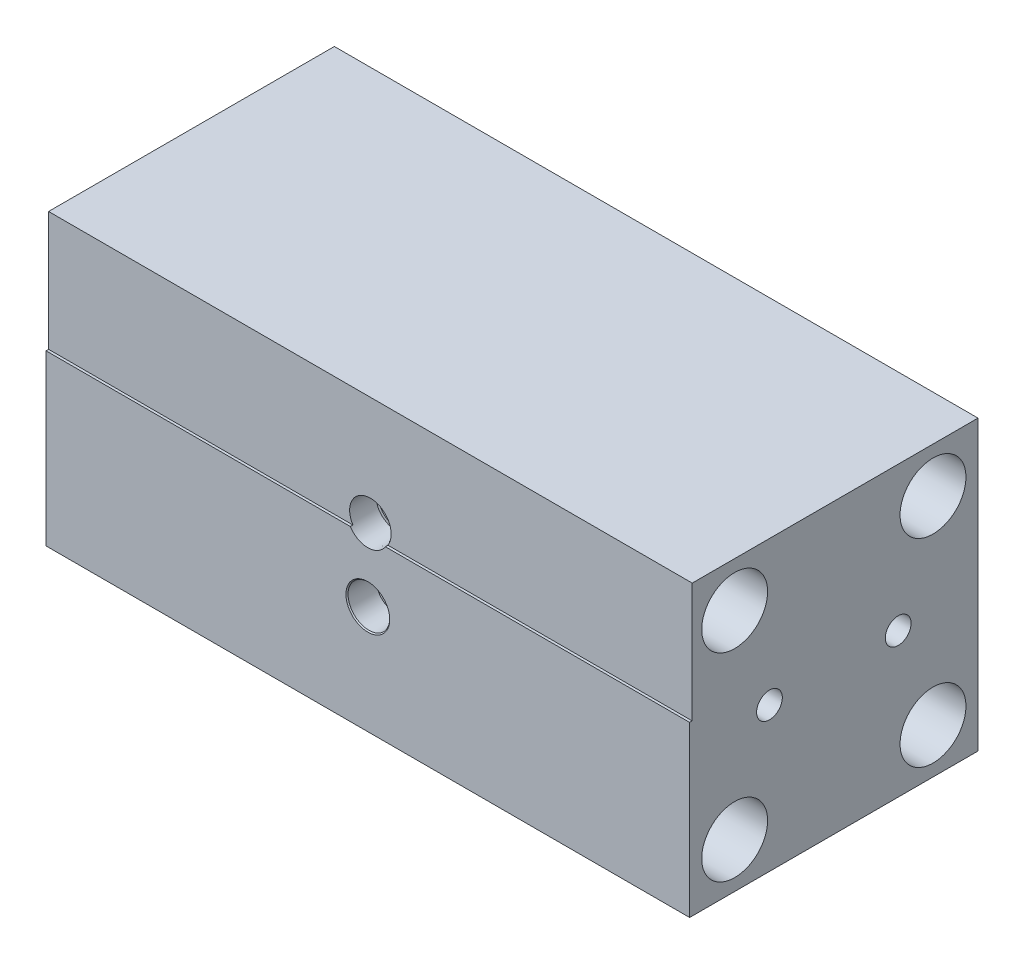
ISO-10303-21;
HEADER;
FILE_DESCRIPTION(('STEP AP214'),'2;1');
FILE_NAME('part.step','',(''),(''),'','','');
FILE_SCHEMA(('AUTOMOTIVE_DESIGN { 1 0 10303 214 1 1 1 1 }'));
ENDSEC;
DATA;
#1=APPLICATION_CONTEXT('core data for automotive mechanical design processes');
#2=APPLICATION_PROTOCOL_DEFINITION('international standard','automotive_design',2000,#1);
#3=PRODUCT_CONTEXT('',#1,'mechanical');
#4=PRODUCT('Part','Part','',(#3));
#5=PRODUCT_RELATED_PRODUCT_CATEGORY('part','',(#4));
#6=PRODUCT_DEFINITION_FORMATION('','',#4);
#7=PRODUCT_DEFINITION_CONTEXT('part definition',#1,'design');
#8=PRODUCT_DEFINITION('design','',#6,#7);
#9=PRODUCT_DEFINITION_SHAPE('','',#8);
#10=(LENGTH_UNIT() NAMED_UNIT(*) SI_UNIT(.MILLI.,.METRE.));
#11=(NAMED_UNIT(*) PLANE_ANGLE_UNIT() SI_UNIT($,.RADIAN.));
#12=(NAMED_UNIT(*) SI_UNIT($,.STERADIAN.) SOLID_ANGLE_UNIT());
#13=UNCERTAINTY_MEASURE_WITH_UNIT(LENGTH_MEASURE(1.E-05),#10,'distance_accuracy_value','');
#14=(GEOMETRIC_REPRESENTATION_CONTEXT(3) GLOBAL_UNCERTAINTY_ASSIGNED_CONTEXT((#13)) GLOBAL_UNIT_ASSIGNED_CONTEXT((#10,
#11,#12)) REPRESENTATION_CONTEXT('',''));
#15=CARTESIAN_POINT('',(0.,0.,0.));
#16=DIRECTION('',(0.,0.,1.));
#17=DIRECTION('',(1.,0.,0.));
#18=AXIS2_PLACEMENT_3D('',#15,#16,#17);
#19=CARTESIAN_POINT('',(-79.375,35.56,35.56));
#20=DIRECTION('',(0.,0.,-1.));
#21=DIRECTION('',(-1.,0.,0.));
#22=AXIS2_PLACEMENT_3D('',#19,#20,#21);
#23=PLANE('',#22);
#24=CARTESIAN_POINT('',(0.,-8.89,35.56));
#25=DIRECTION('',(0.,0.,-1.));
#26=DIRECTION('',(-1.,0.,0.));
#27=AXIS2_PLACEMENT_3D('',#24,#25,#26);
#28=CIRCLE('',#27,5.39780479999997);
#29=CARTESIAN_POINT('',(-5.39780479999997,-8.89,35.56));
#30=VERTEX_POINT('',#29);
#31=EDGE_CURVE('E11',#30,#30,#28,.T.);
#32=ORIENTED_EDGE('',*,*,#31,.T.);
#33=EDGE_LOOP('',(#32));
#34=FACE_BOUND('',#33,.T.);
#35=CARTESIAN_POINT('',(0.,8.89,35.56));
#36=DIRECTION('',(0.,0.,1.));
#37=DIRECTION('',(1.,0.,0.));
#38=AXIS2_PLACEMENT_3D('',#35,#36,#37);
#39=CIRCLE('',#38,5.1438048);
#40=CARTESIAN_POINT('',(-4.33515649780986,6.12140000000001,35.56));
#41=VERTEX_POINT('',#40);
#42=CARTESIAN_POINT('',(4.33515649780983,6.12140000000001,35.56));
#43=VERTEX_POINT('',#42);
#44=EDGE_CURVE('E52',#41,#43,#39,.T.);
#45=ORIENTED_EDGE('',*,*,#44,.F.);
#46=DIRECTION('',(1.,0.,0.));
#47=VECTOR('',#46,1.);
#48=CARTESIAN_POINT('',(-79.375,6.12140000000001,35.56));
#49=LINE('',#48,#47);
#50=CARTESIAN_POINT('',(-79.375,6.12140000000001,35.56));
#51=VERTEX_POINT('',#50);
#52=EDGE_CURVE('E233',#51,#41,#49,.T.);
#53=ORIENTED_EDGE('',*,*,#52,.F.);
#54=DIRECTION('',(0.,-1.,0.));
#55=VECTOR('',#54,1.);
#56=CARTESIAN_POINT('',(-79.375,35.56,35.56));
#57=LINE('',#56,#55);
#58=CARTESIAN_POINT('',(-79.375,-35.56,35.56));
#59=VERTEX_POINT('',#58);
#60=EDGE_CURVE('E235',#51,#59,#57,.T.);
#61=ORIENTED_EDGE('',*,*,#60,.T.);
#62=DIRECTION('',(1.,0.,0.));
#63=VECTOR('',#62,1.);
#64=CARTESIAN_POINT('',(-79.375,-35.56,35.56));
#65=LINE('',#64,#63);
#66=CARTESIAN_POINT('',(79.375,-35.56,35.56));
#67=VERTEX_POINT('',#66);
#68=EDGE_CURVE('E237',#59,#67,#65,.T.);
#69=ORIENTED_EDGE('',*,*,#68,.T.);
#70=DIRECTION('',(0.,1.,0.));
#71=VECTOR('',#70,1.);
#72=CARTESIAN_POINT('',(79.375,-35.56,35.56));
#73=LINE('',#72,#71);
#74=CARTESIAN_POINT('',(79.375,6.12140000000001,35.56));
#75=VERTEX_POINT('',#74);
#76=EDGE_CURVE('E240',#67,#75,#73,.T.);
#77=ORIENTED_EDGE('',*,*,#76,.T.);
#78=EDGE_CURVE('E221',#43,#75,#49,.T.);
#79=ORIENTED_EDGE('',*,*,#78,.F.);
#80=EDGE_LOOP('',(#45,#53,#61,#69,#77,#79));
#81=FACE_BOUND('',#80,.T.);
#82=ADVANCED_FACE('F37',(#34,#81),#23,.F.);
#83=CARTESIAN_POINT('',(-79.375,6.12140000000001,35.56));
#84=DIRECTION('',(0.,-1.,0.));
#85=DIRECTION('',(0.,0.,-1.));
#86=AXIS2_PLACEMENT_3D('',#83,#84,#85);
#87=PLANE('',#86);
#88=ORIENTED_EDGE('',*,*,#52,.T.);
#89=CARTESIAN_POINT('',(-4.67359412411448,6.12140000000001,45.1884141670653));
#90=CARTESIAN_POINT('',(-4.61580467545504,6.12140000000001,43.5278837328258));
#91=CARTESIAN_POINT('',(-4.55774093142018,6.12140000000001,41.8673628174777));
#92=CARTESIAN_POINT('',(-4.44098917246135,6.12140000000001,38.5463432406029));
#93=CARTESIAN_POINT('',(-4.38230115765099,6.12140000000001,36.8858445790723));
#94=CARTESIAN_POINT('',(-4.26422515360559,6.12140000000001,33.5648720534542));
#95=CARTESIAN_POINT('',(-4.20483716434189,6.12140000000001,31.9043981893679));
#96=CARTESIAN_POINT('',(-4.08526250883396,6.12140000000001,28.583478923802));
#97=CARTESIAN_POINT('',(-4.02507584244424,6.12140000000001,26.9230335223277));
#98=CARTESIAN_POINT('',(-3.96444049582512,6.12140000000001,25.2626044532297));
#99=B_SPLINE_CURVE_WITH_KNOTS('',3,(#89,#90,#91,#92,#93,#94,#95,#96,#97,#98),.UNSPECIFIED.,.F.,
.F.,(4,2,2,2,4),(0.,4.98460717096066,9.96921343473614,14.9538199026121,19.9384272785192),.UNSPECIFIED.);
#100=CARTESIAN_POINT('',(-4.3125801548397,6.12140000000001,34.925));
#101=VERTEX_POINT('',#100);
#102=EDGE_CURVE('E269',#41,#101,#99,.T.);
#103=ORIENTED_EDGE('',*,*,#102,.T.);
#104=DIRECTION('',(1.,0.,0.));
#105=VECTOR('',#104,1.);
#106=CARTESIAN_POINT('',(-79.375,6.12140000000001,34.925));
#107=LINE('',#106,#105);
#108=CARTESIAN_POINT('',(-79.375,6.12140000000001,34.925));
#109=VERTEX_POINT('',#108);
#110=EDGE_CURVE('E229',#109,#101,#107,.T.);
#111=ORIENTED_EDGE('',*,*,#110,.F.);
#112=DIRECTION('',(0.,0.,-1.));
#113=VECTOR('',#112,1.);
#114=CARTESIAN_POINT('',(-79.375,6.12140000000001,35.56));
#115=LINE('',#114,#113);
#116=EDGE_CURVE('E60',#51,#109,#115,.T.);
#117=ORIENTED_EDGE('',*,*,#116,.F.);
#118=EDGE_LOOP('',(#88,#103,#111,#117));
#119=FACE_BOUND('',#118,.T.);
#120=ADVANCED_FACE('F355',(#119),#87,.F.);
#121=CARTESIAN_POINT('',(-79.375,35.56,35.56));
#122=DIRECTION('',(1.,0.,0.));
#123=DIRECTION('',(0.,1.,0.));
#124=AXIS2_PLACEMENT_3D('',#121,#122,#123);
#125=PLANE('',#124);
#126=CARTESIAN_POINT('',(-79.375,0.,-15.875));
#127=DIRECTION('',(1.,0.,0.));
#128=DIRECTION('',(0.,0.,-1.));
#129=AXIS2_PLACEMENT_3D('',#126,#127,#128);
#130=CIRCLE('',#129,3.175);
#131=CARTESIAN_POINT('',(-79.375,0.,-19.05));
#132=VERTEX_POINT('',#131);
#133=EDGE_CURVE('E1055',#132,#132,#130,.T.);
#134=ORIENTED_EDGE('',*,*,#133,.T.);
#135=EDGE_LOOP('',(#134));
#136=FACE_BOUND('',#135,.T.);
#137=CARTESIAN_POINT('',(-79.375,0.,15.875));
#138=DIRECTION('',(1.,0.,0.));
#139=DIRECTION('',(0.,0.,-1.));
#140=AXIS2_PLACEMENT_3D('',#137,#138,#139);
#141=CIRCLE('',#140,3.175);
#142=CARTESIAN_POINT('',(-79.375,0.,12.7));
#143=VERTEX_POINT('',#142);
#144=EDGE_CURVE('E1063',#143,#143,#141,.T.);
#145=ORIENTED_EDGE('',*,*,#144,.T.);
#146=EDGE_LOOP('',(#145));
#147=FACE_BOUND('',#146,.T.);
#148=CARTESIAN_POINT('',(-79.375,-24.4602,-24.4602));
#149=DIRECTION('',(1.,0.,0.));
#150=DIRECTION('',(0.,0.,-1.));
#151=AXIS2_PLACEMENT_3D('',#148,#149,#150);
#152=CIRCLE('',#151,8.12799999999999);
#153=CARTESIAN_POINT('',(-79.375,-24.4602,-32.5882));
#154=VERTEX_POINT('',#153);
#155=EDGE_CURVE('E1069',#154,#154,#152,.T.);
#156=ORIENTED_EDGE('',*,*,#155,.T.);
#157=EDGE_LOOP('',(#156));
#158=FACE_BOUND('',#157,.T.);
#159=CARTESIAN_POINT('',(-79.375,-24.4602,24.4602));
#160=DIRECTION('',(1.,0.,0.));
#161=DIRECTION('',(0.,0.,-1.));
#162=AXIS2_PLACEMENT_3D('',#159,#160,#161);
#163=CIRCLE('',#162,8.128);
#164=CARTESIAN_POINT('',(-79.375,-24.4602,16.3322));
#165=VERTEX_POINT('',#164);
#166=EDGE_CURVE('E1075',#165,#165,#163,.T.);
#167=ORIENTED_EDGE('',*,*,#166,.T.);
#168=EDGE_LOOP('',(#167));
#169=FACE_BOUND('',#168,.T.);
#170=CARTESIAN_POINT('',(-79.375,24.4602,-24.4602));
#171=DIRECTION('',(1.,0.,0.));
#172=DIRECTION('',(0.,0.,-1.));
#173=AXIS2_PLACEMENT_3D('',#170,#171,#172);
#174=CIRCLE('',#173,8.12799999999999);
#175=CARTESIAN_POINT('',(-79.375,24.4602,-32.5882));
#176=VERTEX_POINT('',#175);
#177=EDGE_CURVE('E1081',#176,#176,#174,.T.);
#178=ORIENTED_EDGE('',*,*,#177,.T.);
#179=EDGE_LOOP('',(#178));
#180=FACE_BOUND('',#179,.T.);
#181=CARTESIAN_POINT('',(-79.375,24.4602,24.4602));
#182=DIRECTION('',(1.,0.,0.));
#183=DIRECTION('',(0.,0.,-1.));
#184=AXIS2_PLACEMENT_3D('',#181,#182,#183);
#185=CIRCLE('',#184,8.128);
#186=CARTESIAN_POINT('',(-79.375,24.4602,16.3322));
#187=VERTEX_POINT('',#186);
#188=EDGE_CURVE('E154',#187,#187,#185,.T.);
#189=ORIENTED_EDGE('',*,*,#188,.T.);
#190=EDGE_LOOP('',(#189));
#191=FACE_BOUND('',#190,.T.);
#192=ORIENTED_EDGE('',*,*,#116,.T.);
#193=DIRECTION('',(0.,1.,0.));
#194=VECTOR('',#193,1.);
#195=CARTESIAN_POINT('',(-79.375,6.12140000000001,34.925));
#196=LINE('',#195,#194);
#197=CARTESIAN_POINT('',(-79.375,35.56,34.925));
#198=VERTEX_POINT('',#197);
#199=EDGE_CURVE('E217',#109,#198,#196,.T.);
#200=ORIENTED_EDGE('',*,*,#199,.T.);
#201=DIRECTION('',(0.,0.,-1.));
#202=VECTOR('',#201,1.);
#203=CARTESIAN_POINT('',(-79.375,35.56,35.56));
#204=LINE('',#203,#202);
#205=CARTESIAN_POINT('',(-79.375,35.56,-35.56));
#206=VERTEX_POINT('',#205);
#207=EDGE_CURVE('E243',#198,#206,#204,.T.);
#208=ORIENTED_EDGE('',*,*,#207,.T.);
#209=DIRECTION('',(0.,-1.,0.));
#210=VECTOR('',#209,1.);
#211=CARTESIAN_POINT('',(-79.375,35.56,-35.56));
#212=LINE('',#211,#210);
#213=CARTESIAN_POINT('',(-79.375,-35.56,-35.56));
#214=VERTEX_POINT('',#213);
#215=EDGE_CURVE('E228',#206,#214,#212,.T.);
#216=ORIENTED_EDGE('',*,*,#215,.T.);
#217=DIRECTION('',(0.,0.,-1.));
#218=VECTOR('',#217,1.);
#219=CARTESIAN_POINT('',(-79.375,-35.56,35.56));
#220=LINE('',#219,#218);
#221=EDGE_CURVE('E259',#59,#214,#220,.T.);
#222=ORIENTED_EDGE('',*,*,#221,.F.);
#223=ORIENTED_EDGE('',*,*,#60,.F.);
#224=EDGE_LOOP('',(#192,#200,#208,#216,#222,#223));
#225=FACE_BOUND('',#224,.T.);
#226=ADVANCED_FACE('F364',(#136,#147,#158,#169,#180,#191,#225),#125,.F.);
#227=CARTESIAN_POINT('',(-79.375,-35.56,35.56));
#228=DIRECTION('',(0.,1.,0.));
#229=DIRECTION('',(0.,0.,1.));
#230=AXIS2_PLACEMENT_3D('',#227,#228,#229);
#231=PLANE('',#230);
#232=CARTESIAN_POINT('',(57.15,-35.56,0.));
#233=DIRECTION('',(0.,1.,0.));
#234=DIRECTION('',(0.,0.,1.));
#235=AXIS2_PLACEMENT_3D('',#232,#233,#234);
#236=CIRCLE('',#235,2.80670000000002);
#237=CARTESIAN_POINT('',(57.15,-35.56,2.80670000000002));
#238=VERTEX_POINT('',#237);
#239=EDGE_CURVE('E489',#238,#238,#236,.T.);
#240=ORIENTED_EDGE('',*,*,#239,.T.);
#241=EDGE_LOOP('',(#240));
#242=FACE_BOUND('',#241,.T.);
#243=CARTESIAN_POINT('',(38.1,-35.56,0.));
#244=DIRECTION('',(0.,1.,0.));
#245=DIRECTION('',(0.,0.,1.));
#246=AXIS2_PLACEMENT_3D('',#243,#244,#245);
#247=CIRCLE('',#246,3.42900000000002);
#248=CARTESIAN_POINT('',(38.1,-35.56,3.42900000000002));
#249=VERTEX_POINT('',#248);
#250=EDGE_CURVE('E492',#249,#249,#247,.T.);
#251=ORIENTED_EDGE('',*,*,#250,.T.);
#252=EDGE_LOOP('',(#251));
#253=FACE_BOUND('',#252,.T.);
#254=CARTESIAN_POINT('',(19.05,-35.56,0.));
#255=DIRECTION('',(0.,1.,0.));
#256=DIRECTION('',(0.,0.,1.));
#257=AXIS2_PLACEMENT_3D('',#254,#255,#256);
#258=CIRCLE('',#257,2.80670000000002);
#259=CARTESIAN_POINT('',(19.05,-35.56,2.80670000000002));
#260=VERTEX_POINT('',#259);
#261=EDGE_CURVE('E495',#260,#260,#258,.T.);
#262=ORIENTED_EDGE('',*,*,#261,.T.);
#263=EDGE_LOOP('',(#262));
#264=FACE_BOUND('',#263,.T.);
#265=CARTESIAN_POINT('',(-19.05,-35.56,0.));
#266=DIRECTION('',(0.,1.,0.));
#267=DIRECTION('',(0.,0.,1.));
#268=AXIS2_PLACEMENT_3D('',#265,#266,#267);
#269=CIRCLE('',#268,2.80670000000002);
#270=CARTESIAN_POINT('',(-19.05,-35.56,2.80670000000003));
#271=VERTEX_POINT('',#270);
#272=EDGE_CURVE('E498',#271,#271,#269,.T.);
#273=ORIENTED_EDGE('',*,*,#272,.T.);
#274=EDGE_LOOP('',(#273));
#275=FACE_BOUND('',#274,.T.);
#276=CARTESIAN_POINT('',(-38.1,-35.56,0.));
#277=DIRECTION('',(0.,1.,0.));
#278=DIRECTION('',(0.,0.,1.));
#279=AXIS2_PLACEMENT_3D('',#276,#277,#278);
#280=CIRCLE('',#279,3.42899999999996);
#281=CARTESIAN_POINT('',(-38.1,-35.56,3.42899999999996));
#282=VERTEX_POINT('',#281);
#283=EDGE_CURVE('E501',#282,#282,#280,.T.);
#284=ORIENTED_EDGE('',*,*,#283,.T.);
#285=EDGE_LOOP('',(#284));
#286=FACE_BOUND('',#285,.T.);
#287=CARTESIAN_POINT('',(-57.15,-35.56,0.));
#288=DIRECTION('',(0.,1.,0.));
#289=DIRECTION('',(0.,0.,1.));
#290=AXIS2_PLACEMENT_3D('',#287,#288,#289);
#291=CIRCLE('',#290,2.80670000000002);
#292=CARTESIAN_POINT('',(-57.15,-35.56,2.80670000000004));
#293=VERTEX_POINT('',#292);
#294=EDGE_CURVE('E504',#293,#293,#291,.T.);
#295=ORIENTED_EDGE('',*,*,#294,.T.);
#296=EDGE_LOOP('',(#295));
#297=FACE_BOUND('',#296,.T.);
#298=DIRECTION('',(1.,0.,0.));
#299=VECTOR('',#298,1.);
#300=CARTESIAN_POINT('',(-79.375,-35.56,-35.56));
#301=LINE('',#300,#299);
#302=CARTESIAN_POINT('',(79.375,-35.56,-35.56));
#303=VERTEX_POINT('',#302);
#304=EDGE_CURVE('E246',#214,#303,#301,.T.);
#305=ORIENTED_EDGE('',*,*,#304,.T.);
#306=DIRECTION('',(0.,0.,-1.));
#307=VECTOR('',#306,1.);
#308=CARTESIAN_POINT('',(79.375,-35.56,35.56));
#309=LINE('',#308,#307);
#310=EDGE_CURVE('E256',#67,#303,#309,.T.);
#311=ORIENTED_EDGE('',*,*,#310,.F.);
#312=ORIENTED_EDGE('',*,*,#68,.F.);
#313=ORIENTED_EDGE('',*,*,#221,.T.);
#314=EDGE_LOOP('',(#305,#311,#312,#313));
#315=FACE_BOUND('',#314,.T.);
#316=ADVANCED_FACE('F373',(#242,#253,#264,#275,#286,#297,#315),#231,.F.);
#317=CARTESIAN_POINT('',(79.375,-35.56,35.56));
#318=DIRECTION('',(-1.,0.,0.));
#319=DIRECTION('',(0.,0.,1.));
#320=AXIS2_PLACEMENT_3D('',#317,#318,#319);
#321=PLANE('',#320);
#322=CARTESIAN_POINT('',(79.375,0.,-15.875));
#323=DIRECTION('',(1.,0.,0.));
#324=DIRECTION('',(0.,0.,-1.));
#325=AXIS2_PLACEMENT_3D('',#322,#323,#324);
#326=CIRCLE('',#325,3.175);
#327=CARTESIAN_POINT('',(79.375,0.,-19.05));
#328=VERTEX_POINT('',#327);
#329=EDGE_CURVE('E1058',#328,#328,#326,.T.);
#330=ORIENTED_EDGE('',*,*,#329,.F.);
#331=EDGE_LOOP('',(#330));
#332=FACE_BOUND('',#331,.T.);
#333=CARTESIAN_POINT('',(79.375,0.,15.875));
#334=DIRECTION('',(1.,0.,0.));
#335=DIRECTION('',(0.,0.,-1.));
#336=AXIS2_PLACEMENT_3D('',#333,#334,#335);
#337=CIRCLE('',#336,3.175);
#338=CARTESIAN_POINT('',(79.375,0.,12.7));
#339=VERTEX_POINT('',#338);
#340=EDGE_CURVE('E1060',#339,#339,#337,.T.);
#341=ORIENTED_EDGE('',*,*,#340,.F.);
#342=EDGE_LOOP('',(#341));
#343=FACE_BOUND('',#342,.T.);
#344=CARTESIAN_POINT('',(79.375,-24.4602,-24.4602));
#345=DIRECTION('',(1.,0.,0.));
#346=DIRECTION('',(0.,0.,-1.));
#347=AXIS2_PLACEMENT_3D('',#344,#345,#346);
#348=CIRCLE('',#347,8.12799999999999);
#349=CARTESIAN_POINT('',(79.375,-24.4602,-32.5882));
#350=VERTEX_POINT('',#349);
#351=EDGE_CURVE('E1066',#350,#350,#348,.T.);
#352=ORIENTED_EDGE('',*,*,#351,.F.);
#353=EDGE_LOOP('',(#352));
#354=FACE_BOUND('',#353,.T.);
#355=CARTESIAN_POINT('',(79.375,-24.4602,24.4602));
#356=DIRECTION('',(1.,0.,0.));
#357=DIRECTION('',(0.,0.,-1.));
#358=AXIS2_PLACEMENT_3D('',#355,#356,#357);
#359=CIRCLE('',#358,8.128);
#360=CARTESIAN_POINT('',(79.375,-24.4602,16.3322));
#361=VERTEX_POINT('',#360);
#362=EDGE_CURVE('E1072',#361,#361,#359,.T.);
#363=ORIENTED_EDGE('',*,*,#362,.F.);
#364=EDGE_LOOP('',(#363));
#365=FACE_BOUND('',#364,.T.);
#366=CARTESIAN_POINT('',(79.375,24.4602,-24.4602));
#367=DIRECTION('',(1.,0.,0.));
#368=DIRECTION('',(0.,0.,-1.));
#369=AXIS2_PLACEMENT_3D('',#366,#367,#368);
#370=CIRCLE('',#369,8.12799999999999);
#371=CARTESIAN_POINT('',(79.375,24.4602,-32.5882));
#372=VERTEX_POINT('',#371);
#373=EDGE_CURVE('E1078',#372,#372,#370,.T.);
#374=ORIENTED_EDGE('',*,*,#373,.F.);
#375=EDGE_LOOP('',(#374));
#376=FACE_BOUND('',#375,.T.);
#377=CARTESIAN_POINT('',(79.375,24.4602,24.4602));
#378=DIRECTION('',(1.,0.,0.));
#379=DIRECTION('',(0.,0.,-1.));
#380=AXIS2_PLACEMENT_3D('',#377,#378,#379);
#381=CIRCLE('',#380,8.128);
#382=CARTESIAN_POINT('',(79.375,24.4602,16.3322));
#383=VERTEX_POINT('',#382);
#384=EDGE_CURVE('E160',#383,#383,#381,.T.);
#385=ORIENTED_EDGE('',*,*,#384,.F.);
#386=EDGE_LOOP('',(#385));
#387=FACE_BOUND('',#386,.T.);
#388=DIRECTION('',(0.,0.,-1.));
#389=VECTOR('',#388,1.);
#390=CARTESIAN_POINT('',(79.375,35.56,35.56));
#391=LINE('',#390,#389);
#392=CARTESIAN_POINT('',(79.375,35.56,34.925));
#393=VERTEX_POINT('',#392);
#394=CARTESIAN_POINT('',(79.375,35.56,-35.56));
#395=VERTEX_POINT('',#394);
#396=EDGE_CURVE('E254',#393,#395,#391,.T.);
#397=ORIENTED_EDGE('',*,*,#396,.F.);
#398=DIRECTION('',(0.,1.,0.));
#399=VECTOR('',#398,1.);
#400=CARTESIAN_POINT('',(79.375,6.12140000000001,34.925));
#401=LINE('',#400,#399);
#402=CARTESIAN_POINT('',(79.375,6.12140000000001,34.925));
#403=VERTEX_POINT('',#402);
#404=EDGE_CURVE('E218',#403,#393,#401,.T.);
#405=ORIENTED_EDGE('',*,*,#404,.F.);
#406=DIRECTION('',(0.,0.,-1.));
#407=VECTOR('',#406,1.);
#408=CARTESIAN_POINT('',(79.375,6.12140000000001,35.56));
#409=LINE('',#408,#407);
#410=EDGE_CURVE('E215',#75,#403,#409,.T.);
#411=ORIENTED_EDGE('',*,*,#410,.F.);
#412=ORIENTED_EDGE('',*,*,#76,.F.);
#413=ORIENTED_EDGE('',*,*,#310,.T.);
#414=DIRECTION('',(0.,1.,0.));
#415=VECTOR('',#414,1.);
#416=CARTESIAN_POINT('',(79.375,-35.56,-35.56));
#417=LINE('',#416,#415);
#418=EDGE_CURVE('E248',#303,#395,#417,.T.);
#419=ORIENTED_EDGE('',*,*,#418,.T.);
#420=EDGE_LOOP('',(#397,#405,#411,#412,#413,#419));
#421=FACE_BOUND('',#420,.T.);
#422=ADVANCED_FACE('F369',(#332,#343,#354,#365,#376,#387,#421),#321,.F.);
#423=CARTESIAN_POINT('',(79.375,35.56,35.56));
#424=DIRECTION('',(0.,-1.,0.));
#425=DIRECTION('',(1.,0.,0.));
#426=AXIS2_PLACEMENT_3D('',#423,#424,#425);
#427=PLANE('',#426);
#428=ORIENTED_EDGE('',*,*,#207,.F.);
#429=DIRECTION('',(1.,0.,0.));
#430=VECTOR('',#429,1.);
#431=CARTESIAN_POINT('',(-79.375,35.56,34.925));
#432=LINE('',#431,#430);
#433=EDGE_CURVE('E225',#198,#393,#432,.T.);
#434=ORIENTED_EDGE('',*,*,#433,.T.);
#435=ORIENTED_EDGE('',*,*,#396,.T.);
#436=DIRECTION('',(-1.,0.,0.));
#437=VECTOR('',#436,1.);
#438=CARTESIAN_POINT('',(79.375,35.56,-35.56));
#439=LINE('',#438,#437);
#440=EDGE_CURVE('E238',#395,#206,#439,.T.);
#441=ORIENTED_EDGE('',*,*,#440,.T.);
#442=EDGE_LOOP('',(#428,#434,#435,#441));
#443=FACE_BOUND('',#442,.T.);
#444=ADVANCED_FACE('F356',(#443),#427,.F.);
#445=CARTESIAN_POINT('',(-79.375,35.56,-35.56));
#446=DIRECTION('',(0.,0.,-1.));
#447=DIRECTION('',(-1.,0.,0.));
#448=AXIS2_PLACEMENT_3D('',#445,#446,#447);
#449=PLANE('',#448);
#450=CARTESIAN_POINT('',(-63.5,-10.16,-35.56));
#451=DIRECTION('',(0.,0.,-1.));
#452=DIRECTION('',(-1.,0.,0.));
#453=AXIS2_PLACEMENT_3D('',#450,#451,#452);
#454=CIRCLE('',#453,2.80670000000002);
#455=CARTESIAN_POINT('',(-66.3067,-10.16,-35.56));
#456=VERTEX_POINT('',#455);
#457=EDGE_CURVE('E455',#456,#456,#454,.F.);
#458=ORIENTED_EDGE('',*,*,#457,.T.);
#459=EDGE_LOOP('',(#458));
#460=FACE_BOUND('',#459,.T.);
#461=CARTESIAN_POINT('',(63.5,-10.16,-35.56));
#462=DIRECTION('',(0.,0.,-1.));
#463=DIRECTION('',(-1.,0.,0.));
#464=AXIS2_PLACEMENT_3D('',#461,#462,#463);
#465=CIRCLE('',#464,2.80670000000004);
#466=CARTESIAN_POINT('',(60.6933,-10.16,-35.56));
#467=VERTEX_POINT('',#466);
#468=EDGE_CURVE('E458',#467,#467,#465,.F.);
#469=ORIENTED_EDGE('',*,*,#468,.T.);
#470=EDGE_LOOP('',(#469));
#471=FACE_BOUND('',#470,.T.);
#472=CARTESIAN_POINT('',(-63.5,10.16,-35.56));
#473=DIRECTION('',(0.,0.,-1.));
#474=DIRECTION('',(-1.,0.,0.));
#475=AXIS2_PLACEMENT_3D('',#472,#473,#474);
#476=CIRCLE('',#475,2.80670000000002);
#477=CARTESIAN_POINT('',(-66.3067,10.16,-35.56));
#478=VERTEX_POINT('',#477);
#479=EDGE_CURVE('E461',#478,#478,#476,.F.);
#480=ORIENTED_EDGE('',*,*,#479,.T.);
#481=EDGE_LOOP('',(#480));
#482=FACE_BOUND('',#481,.T.);
#483=CARTESIAN_POINT('',(50.8,-10.16,-35.56));
#484=DIRECTION('',(0.,0.,-1.));
#485=DIRECTION('',(-1.,0.,0.));
#486=AXIS2_PLACEMENT_3D('',#483,#484,#485);
#487=CIRCLE('',#486,3.42900000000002);
#488=CARTESIAN_POINT('',(47.371,-10.16,-35.56));
#489=VERTEX_POINT('',#488);
#490=EDGE_CURVE('E464',#489,#489,#487,.F.);
#491=ORIENTED_EDGE('',*,*,#490,.T.);
#492=EDGE_LOOP('',(#491));
#493=FACE_BOUND('',#492,.T.);
#494=CARTESIAN_POINT('',(-50.8,10.16,-35.56));
#495=DIRECTION('',(0.,0.,-1.));
#496=DIRECTION('',(-1.,0.,0.));
#497=AXIS2_PLACEMENT_3D('',#494,#495,#496);
#498=CIRCLE('',#497,3.42899999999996);
#499=CARTESIAN_POINT('',(-54.229,10.16,-35.56));
#500=VERTEX_POINT('',#499);
#501=EDGE_CURVE('E467',#500,#500,#498,.F.);
#502=ORIENTED_EDGE('',*,*,#501,.T.);
#503=EDGE_LOOP('',(#502));
#504=FACE_BOUND('',#503,.T.);
#505=CARTESIAN_POINT('',(63.5,10.16,-35.56));
#506=DIRECTION('',(0.,0.,-1.));
#507=DIRECTION('',(-1.,0.,0.));
#508=AXIS2_PLACEMENT_3D('',#505,#506,#507);
#509=CIRCLE('',#508,2.80670000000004);
#510=CARTESIAN_POINT('',(60.6933,10.16,-35.56));
#511=VERTEX_POINT('',#510);
#512=EDGE_CURVE('E435',#511,#511,#509,.F.);
#513=ORIENTED_EDGE('',*,*,#512,.T.);
#514=EDGE_LOOP('',(#513));
#515=FACE_BOUND('',#514,.T.);
#516=ORIENTED_EDGE('',*,*,#215,.F.);
#517=ORIENTED_EDGE('',*,*,#440,.F.);
#518=ORIENTED_EDGE('',*,*,#418,.F.);
#519=ORIENTED_EDGE('',*,*,#304,.F.);
#520=EDGE_LOOP('',(#516,#517,#518,#519));
#521=FACE_BOUND('',#520,.T.);
#522=ADVANCED_FACE('F348',(#460,#471,#482,#493,#504,#515,#521),#449,.T.);
#523=CARTESIAN_POINT('',(-79.375,6.12140000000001,34.925));
#524=DIRECTION('',(0.,0.,-1.));
#525=DIRECTION('',(-1.,0.,0.));
#526=AXIS2_PLACEMENT_3D('',#523,#524,#525);
#527=PLANE('',#526);
#528=ORIENTED_EDGE('',*,*,#110,.T.);
#529=CARTESIAN_POINT('',(0.,8.89,34.925));
#530=DIRECTION('',(0.,0.,-1.));
#531=DIRECTION('',(-1.,0.,0.));
#532=AXIS2_PLACEMENT_3D('',#529,#530,#531);
#533=CIRCLE('',#532,5.12479204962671);
#534=CARTESIAN_POINT('',(4.3125801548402,6.12140000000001,34.9249999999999));
#535=VERTEX_POINT('',#534);
#536=EDGE_CURVE('E194',#101,#535,#533,.T.);
#537=ORIENTED_EDGE('',*,*,#536,.T.);
#538=EDGE_CURVE('E232',#535,#403,#107,.T.);
#539=ORIENTED_EDGE('',*,*,#538,.T.);
#540=ORIENTED_EDGE('',*,*,#404,.T.);
#541=ORIENTED_EDGE('',*,*,#433,.F.);
#542=ORIENTED_EDGE('',*,*,#199,.F.);
#543=EDGE_LOOP('',(#528,#537,#539,#540,#541,#542));
#544=FACE_BOUND('',#543,.T.);
#545=ADVANCED_FACE('F346',(#544),#527,.F.);
#546=ORIENTED_EDGE('',*,*,#538,.F.);
#547=CARTESIAN_POINT('',(3.96444049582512,6.12140000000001,25.2626044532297));
#548=CARTESIAN_POINT('',(4.02507584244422,6.12140000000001,26.9230335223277));
#549=CARTESIAN_POINT('',(4.08526250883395,6.12140000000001,28.583478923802));
#550=CARTESIAN_POINT('',(4.2048371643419,6.12140000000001,31.9043981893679));
#551=CARTESIAN_POINT('',(4.26422515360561,6.12140000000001,33.5648720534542));
#552=CARTESIAN_POINT('',(4.38230115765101,6.12140000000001,36.8858445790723));
#553=CARTESIAN_POINT('',(4.44098917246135,6.12140000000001,38.5463432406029));
#554=CARTESIAN_POINT('',(4.55774093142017,6.12140000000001,41.8673628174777));
#555=CARTESIAN_POINT('',(4.61580467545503,6.12140000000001,43.5278837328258));
#556=CARTESIAN_POINT('',(4.67359412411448,6.12140000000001,45.1884141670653));
#557=B_SPLINE_CURVE_WITH_KNOTS('',3,(#547,#548,#549,#550,#551,#552,#553,#554,#555,#556),
.UNSPECIFIED.,.F.,.F.,(4,2,2,2,4),(0.,4.98460737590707,9.96921384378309,14.9538201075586,
19.9384272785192),.UNSPECIFIED.);
#558=EDGE_CURVE('E262',#535,#43,#557,.T.);
#559=ORIENTED_EDGE('',*,*,#558,.T.);
#560=ORIENTED_EDGE('',*,*,#78,.T.);
#561=ORIENTED_EDGE('',*,*,#410,.T.);
#562=EDGE_LOOP('',(#546,#559,#560,#561));
#563=FACE_BOUND('',#562,.T.);
#564=ADVANCED_FACE('F274',(#563),#87,.F.);
#565=CARTESIAN_POINT('',(19.05,-21.2598,0.));
#566=DIRECTION('',(0.,-1.,0.));
#567=DIRECTION('',(0.,0.,-1.));
#568=AXIS2_PLACEMENT_3D('',#565,#566,#567);
#569=CONICAL_SURFACE('',#568,2.5527,1.02974425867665);
#570=CARTESIAN_POINT('',(19.05,-19.7259830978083,0.));
#571=VERTEX_POINT('',#570);
#572=VERTEX_LOOP('',#571);
#573=FACE_BOUND('',#572,.T.);
#574=CARTESIAN_POINT('',(19.05,-21.2598,0.));
#575=DIRECTION('',(0.,-1.,0.));
#576=DIRECTION('',(0.,0.,-1.));
#577=AXIS2_PLACEMENT_3D('',#574,#575,#576);
#578=CIRCLE('',#577,2.5527);
#579=CARTESIAN_POINT('',(19.05,-21.2598,-2.5527));
#580=VERTEX_POINT('',#579);
#581=EDGE_CURVE('E212',#580,#580,#578,.T.);
#582=ORIENTED_EDGE('',*,*,#581,.T.);
#583=EDGE_LOOP('',(#582));
#584=FACE_BOUND('',#583,.T.);
#585=ADVANCED_FACE('F342',(#573,#584),#569,.F.);
#586=CARTESIAN_POINT('',(19.05,-35.56,0.));
#587=DIRECTION('',(0.,-1.,0.));
#588=DIRECTION('',(0.,0.,-1.));
#589=AXIS2_PLACEMENT_3D('',#586,#587,#588);
#590=CYLINDRICAL_SURFACE('',#589,2.5527);
#591=CARTESIAN_POINT('',(19.05,-35.306,0.));
#592=DIRECTION('',(0.,1.,0.));
#593=DIRECTION('',(0.,0.,1.));
#594=AXIS2_PLACEMENT_3D('',#591,#592,#593);
#595=CIRCLE('',#594,2.5527);
#596=CARTESIAN_POINT('',(19.05,-35.306,2.5527));
#597=VERTEX_POINT('',#596);
#598=EDGE_CURVE('E483',#597,#597,#595,.F.);
#599=ORIENTED_EDGE('',*,*,#598,.T.);
#600=EDGE_LOOP('',(#599));
#601=FACE_BOUND('',#600,.T.);
#602=ORIENTED_EDGE('',*,*,#581,.F.);
#603=EDGE_LOOP('',(#602));
#604=FACE_BOUND('',#603,.T.);
#605=ADVANCED_FACE('F338',(#601,#604),#590,.F.);
#606=CARTESIAN_POINT('',(-19.05,-21.2598,0.));
#607=DIRECTION('',(0.,-1.,0.));
#608=DIRECTION('',(0.,0.,-1.));
#609=AXIS2_PLACEMENT_3D('',#606,#607,#608);
#610=CONICAL_SURFACE('',#609,2.5527,1.02974425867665);
#611=CARTESIAN_POINT('',(-19.05,-19.7259830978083,0.));
#612=VERTEX_POINT('',#611);
#613=VERTEX_LOOP('',#612);
#614=FACE_BOUND('',#613,.T.);
#615=CARTESIAN_POINT('',(-19.05,-21.2598,0.));
#616=DIRECTION('',(0.,-1.,0.));
#617=DIRECTION('',(0.,0.,-1.));
#618=AXIS2_PLACEMENT_3D('',#615,#616,#617);
#619=CIRCLE('',#618,2.5527);
#620=CARTESIAN_POINT('',(-19.05,-21.2598,-2.55269999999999));
#621=VERTEX_POINT('',#620);
#622=EDGE_CURVE('E209',#621,#621,#619,.T.);
#623=ORIENTED_EDGE('',*,*,#622,.T.);
#624=EDGE_LOOP('',(#623));
#625=FACE_BOUND('',#624,.T.);
#626=ADVANCED_FACE('F334',(#614,#625),#610,.F.);
#627=CARTESIAN_POINT('',(-19.05,-35.56,0.));
#628=DIRECTION('',(0.,-1.,0.));
#629=DIRECTION('',(0.,0.,-1.));
#630=AXIS2_PLACEMENT_3D('',#627,#628,#629);
#631=CYLINDRICAL_SURFACE('',#630,2.5527);
#632=CARTESIAN_POINT('',(-19.05,-35.306,0.));
#633=DIRECTION('',(0.,1.,0.));
#634=DIRECTION('',(0.,0.,1.));
#635=AXIS2_PLACEMENT_3D('',#632,#633,#634);
#636=CIRCLE('',#635,2.5527);
#637=CARTESIAN_POINT('',(-19.05,-35.306,2.5527));
#638=VERTEX_POINT('',#637);
#639=EDGE_CURVE('E480',#638,#638,#636,.F.);
#640=ORIENTED_EDGE('',*,*,#639,.T.);
#641=EDGE_LOOP('',(#640));
#642=FACE_BOUND('',#641,.T.);
#643=ORIENTED_EDGE('',*,*,#622,.F.);
#644=EDGE_LOOP('',(#643));
#645=FACE_BOUND('',#644,.T.);
#646=ADVANCED_FACE('F330',(#642,#645),#631,.F.);
#647=CARTESIAN_POINT('',(57.15,-21.2598,0.));
#648=DIRECTION('',(0.,-1.,0.));
#649=DIRECTION('',(0.,0.,-1.));
#650=AXIS2_PLACEMENT_3D('',#647,#648,#649);
#651=CONICAL_SURFACE('',#650,2.5527,1.02974425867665);
#652=CARTESIAN_POINT('',(57.15,-19.7259830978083,0.));
#653=VERTEX_POINT('',#652);
#654=VERTEX_LOOP('',#653);
#655=FACE_BOUND('',#654,.T.);
#656=CARTESIAN_POINT('',(57.15,-21.2598,0.));
#657=DIRECTION('',(0.,-1.,0.));
#658=DIRECTION('',(0.,0.,-1.));
#659=AXIS2_PLACEMENT_3D('',#656,#657,#658);
#660=CIRCLE('',#659,2.5527);
#661=CARTESIAN_POINT('',(57.15,-21.2598,-2.5527));
#662=VERTEX_POINT('',#661);
#663=EDGE_CURVE('E206',#662,#662,#660,.T.);
#664=ORIENTED_EDGE('',*,*,#663,.T.);
#665=EDGE_LOOP('',(#664));
#666=FACE_BOUND('',#665,.T.);
#667=ADVANCED_FACE('F326',(#655,#666),#651,.F.);
#668=CARTESIAN_POINT('',(57.15,-35.56,0.));
#669=DIRECTION('',(0.,-1.,0.));
#670=DIRECTION('',(0.,0.,-1.));
#671=AXIS2_PLACEMENT_3D('',#668,#669,#670);
#672=CYLINDRICAL_SURFACE('',#671,2.5527);
#673=CARTESIAN_POINT('',(57.15,-35.306,0.));
#674=DIRECTION('',(0.,1.,0.));
#675=DIRECTION('',(0.,0.,1.));
#676=AXIS2_PLACEMENT_3D('',#673,#674,#675);
#677=CIRCLE('',#676,2.5527);
#678=CARTESIAN_POINT('',(57.15,-35.306,2.55269999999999));
#679=VERTEX_POINT('',#678);
#680=EDGE_CURVE('E506',#679,#679,#677,.F.);
#681=ORIENTED_EDGE('',*,*,#680,.T.);
#682=EDGE_LOOP('',(#681));
#683=FACE_BOUND('',#682,.T.);
#684=ORIENTED_EDGE('',*,*,#663,.F.);
#685=EDGE_LOOP('',(#684));
#686=FACE_BOUND('',#685,.T.);
#687=ADVANCED_FACE('F322',(#683,#686),#672,.F.);
#688=CARTESIAN_POINT('',(-57.15,-21.2598,0.));
#689=DIRECTION('',(0.,-1.,0.));
#690=DIRECTION('',(0.,0.,-1.));
#691=AXIS2_PLACEMENT_3D('',#688,#689,#690);
#692=CONICAL_SURFACE('',#691,2.5527,1.02974425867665);
#693=CARTESIAN_POINT('',(-57.15,-19.7259830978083,0.));
#694=VERTEX_POINT('',#693);
#695=VERTEX_LOOP('',#694);
#696=FACE_BOUND('',#695,.T.);
#697=CARTESIAN_POINT('',(-57.15,-21.2598,0.));
#698=DIRECTION('',(0.,-1.,0.));
#699=DIRECTION('',(0.,0.,-1.));
#700=AXIS2_PLACEMENT_3D('',#697,#698,#699);
#701=CIRCLE('',#700,2.5527);
#702=CARTESIAN_POINT('',(-57.15,-21.2598,-2.55269999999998));
#703=VERTEX_POINT('',#702);
#704=EDGE_CURVE('E203',#703,#703,#701,.T.);
#705=ORIENTED_EDGE('',*,*,#704,.T.);
#706=EDGE_LOOP('',(#705));
#707=FACE_BOUND('',#706,.T.);
#708=ADVANCED_FACE('F318',(#696,#707),#692,.F.);
#709=CARTESIAN_POINT('',(-57.15,-35.56,0.));
#710=DIRECTION('',(0.,-1.,0.));
#711=DIRECTION('',(0.,0.,-1.));
#712=AXIS2_PLACEMENT_3D('',#709,#710,#711);
#713=CYLINDRICAL_SURFACE('',#712,2.5527);
#714=CARTESIAN_POINT('',(-57.15,-35.306,0.));
#715=DIRECTION('',(0.,1.,0.));
#716=DIRECTION('',(0.,0.,1.));
#717=AXIS2_PLACEMENT_3D('',#714,#715,#716);
#718=CIRCLE('',#717,2.5527);
#719=CARTESIAN_POINT('',(-57.15,-35.306,2.55270000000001));
#720=VERTEX_POINT('',#719);
#721=EDGE_CURVE('E474',#720,#720,#718,.F.);
#722=ORIENTED_EDGE('',*,*,#721,.T.);
#723=EDGE_LOOP('',(#722));
#724=FACE_BOUND('',#723,.T.);
#725=ORIENTED_EDGE('',*,*,#704,.F.);
#726=EDGE_LOOP('',(#725));
#727=FACE_BOUND('',#726,.T.);
#728=ADVANCED_FACE('F314',(#724,#727),#713,.F.);
#729=CARTESIAN_POINT('',(38.1,-29.21,0.));
#730=DIRECTION('',(0.,-1.,0.));
#731=DIRECTION('',(0.,0.,-1.));
#732=AXIS2_PLACEMENT_3D('',#729,#730,#731);
#733=CONICAL_SURFACE('',#732,3.175,1.02974425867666);
#734=CARTESIAN_POINT('',(38.1,-27.3022675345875,0.));
#735=VERTEX_POINT('',#734);
#736=VERTEX_LOOP('',#735);
#737=FACE_BOUND('',#736,.T.);
#738=CARTESIAN_POINT('',(38.1,-29.21,0.));
#739=DIRECTION('',(0.,-1.,0.));
#740=DIRECTION('',(0.,0.,-1.));
#741=AXIS2_PLACEMENT_3D('',#738,#739,#740);
#742=CIRCLE('',#741,3.175);
#743=CARTESIAN_POINT('',(38.1,-29.21,-3.17499999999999));
#744=VERTEX_POINT('',#743);
#745=EDGE_CURVE('E200',#744,#744,#742,.T.);
#746=ORIENTED_EDGE('',*,*,#745,.T.);
#747=EDGE_LOOP('',(#746));
#748=FACE_BOUND('',#747,.T.);
#749=ADVANCED_FACE('F310',(#737,#748),#733,.F.);
#750=CARTESIAN_POINT('',(38.1,-35.56,0.));
#751=DIRECTION('',(0.,-1.,0.));
#752=DIRECTION('',(0.,0.,-1.));
#753=AXIS2_PLACEMENT_3D('',#750,#751,#752);
#754=CYLINDRICAL_SURFACE('',#753,3.175);
#755=CARTESIAN_POINT('',(38.1,-35.306,0.));
#756=DIRECTION('',(0.,1.,0.));
#757=DIRECTION('',(0.,0.,1.));
#758=AXIS2_PLACEMENT_3D('',#755,#756,#757);
#759=CIRCLE('',#758,3.175);
#760=CARTESIAN_POINT('',(38.1,-35.306,3.175));
#761=VERTEX_POINT('',#760);
#762=EDGE_CURVE('E486',#761,#761,#759,.F.);
#763=ORIENTED_EDGE('',*,*,#762,.T.);
#764=EDGE_LOOP('',(#763));
#765=FACE_BOUND('',#764,.T.);
#766=ORIENTED_EDGE('',*,*,#745,.F.);
#767=EDGE_LOOP('',(#766));
#768=FACE_BOUND('',#767,.T.);
#769=ADVANCED_FACE('F306',(#765,#768),#754,.F.);
#770=CARTESIAN_POINT('',(-38.1,-29.21,0.));
#771=DIRECTION('',(0.,-1.,0.));
#772=DIRECTION('',(0.,0.,-1.));
#773=AXIS2_PLACEMENT_3D('',#770,#771,#772);
#774=CONICAL_SURFACE('',#773,3.175,1.02974425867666);
#775=CARTESIAN_POINT('',(-38.1,-27.3022675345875,0.));
#776=VERTEX_POINT('',#775);
#777=VERTEX_LOOP('',#776);
#778=FACE_BOUND('',#777,.T.);
#779=CARTESIAN_POINT('',(-38.1,-29.21,0.));
#780=DIRECTION('',(0.,-1.,0.));
#781=DIRECTION('',(0.,0.,-1.));
#782=AXIS2_PLACEMENT_3D('',#779,#780,#781);
#783=CIRCLE('',#782,3.175);
#784=CARTESIAN_POINT('',(-38.1,-29.21,-3.175));
#785=VERTEX_POINT('',#784);
#786=EDGE_CURVE('E197',#785,#785,#783,.T.);
#787=ORIENTED_EDGE('',*,*,#786,.T.);
#788=EDGE_LOOP('',(#787));
#789=FACE_BOUND('',#788,.T.);
#790=ADVANCED_FACE('F302',(#778,#789),#774,.F.);
#791=CARTESIAN_POINT('',(-38.1,-35.56,0.));
#792=DIRECTION('',(0.,-1.,0.));
#793=DIRECTION('',(0.,0.,-1.));
#794=AXIS2_PLACEMENT_3D('',#791,#792,#793);
#795=CYLINDRICAL_SURFACE('',#794,3.175);
#796=CARTESIAN_POINT('',(-38.1,-35.306,0.));
#797=DIRECTION('',(0.,1.,0.));
#798=DIRECTION('',(0.,0.,1.));
#799=AXIS2_PLACEMENT_3D('',#796,#797,#798);
#800=CIRCLE('',#799,3.175);
#801=CARTESIAN_POINT('',(-38.1,-35.306,3.175));
#802=VERTEX_POINT('',#801);
#803=EDGE_CURVE('E477',#802,#802,#800,.F.);
#804=ORIENTED_EDGE('',*,*,#803,.T.);
#805=EDGE_LOOP('',(#804));
#806=FACE_BOUND('',#805,.T.);
#807=ORIENTED_EDGE('',*,*,#786,.F.);
#808=EDGE_LOOP('',(#807));
#809=FACE_BOUND('',#808,.T.);
#810=ADVANCED_FACE('F284',(#806,#809),#795,.F.);
#811=CARTESIAN_POINT('',(0.,8.89,35.56));
#812=DIRECTION('',(0.,0.,1.));
#813=DIRECTION('',(1.,0.,0.));
#814=AXIS2_PLACEMENT_3D('',#811,#812,#813);
#815=CONICAL_SURFACE('',#814,5.1438048,0.0299323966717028);
#816=CARTESIAN_POINT('',(0.,8.89,28.6258));
#817=DIRECTION('',(0.,0.,1.));
#818=DIRECTION('',(1.,0.,0.));
#819=AXIS2_PLACEMENT_3D('',#816,#817,#818);
#820=CIRCLE('',#819,4.9361855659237);
#821=CARTESIAN_POINT('',(4.9361855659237,8.89,28.6258));
#822=VERTEX_POINT('',#821);
#823=EDGE_CURVE('E185',#822,#822,#820,.T.);
#824=ORIENTED_EDGE('',*,*,#823,.F.);
#825=EDGE_LOOP('',(#824));
#826=FACE_BOUND('',#825,.T.);
#827=ORIENTED_EDGE('',*,*,#44,.T.);
#828=ORIENTED_EDGE('',*,*,#558,.F.);
#829=ORIENTED_EDGE('',*,*,#536,.F.);
#830=ORIENTED_EDGE('',*,*,#102,.F.);
#831=EDGE_LOOP('',(#827,#828,#829,#830));
#832=FACE_BOUND('',#831,.T.);
#833=ADVANCED_FACE('F278',(#826,#832),#815,.F.);
#834=CARTESIAN_POINT('',(0.,8.89,23.9268));
#835=DIRECTION('',(0.,0.,1.));
#836=DIRECTION('',(1.,0.,0.));
#837=AXIS2_PLACEMENT_3D('',#834,#835,#836);
#838=CONICAL_SURFACE('',#837,4.2164,1.02974425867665);
#839=CARTESIAN_POINT('',(0.,8.89,21.3933312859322));
#840=VERTEX_POINT('',#839);
#841=VERTEX_LOOP('',#840);
#842=FACE_BOUND('',#841,.T.);
#843=CARTESIAN_POINT('',(0.,8.89,23.9268));
#844=DIRECTION('',(0.,0.,1.));
#845=DIRECTION('',(1.,0.,0.));
#846=AXIS2_PLACEMENT_3D('',#843,#844,#845);
#847=CIRCLE('',#846,4.2164);
#848=CARTESIAN_POINT('',(4.2164,8.89,23.9268));
#849=VERTEX_POINT('',#848);
#850=EDGE_CURVE('E191',#849,#849,#847,.T.);
#851=ORIENTED_EDGE('',*,*,#850,.T.);
#852=EDGE_LOOP('',(#851));
#853=FACE_BOUND('',#852,.T.);
#854=ADVANCED_FACE('F283',(#842,#853),#838,.F.);
#855=CARTESIAN_POINT('',(0.,8.89,35.56));
#856=DIRECTION('',(0.,0.,1.));
#857=DIRECTION('',(1.,0.,0.));
#858=AXIS2_PLACEMENT_3D('',#855,#856,#857);
#859=CYLINDRICAL_SURFACE('',#858,4.2164);
#860=ORIENTED_EDGE('',*,*,#850,.F.);
#861=EDGE_LOOP('',(#860));
#862=FACE_BOUND('',#861,.T.);
#863=CARTESIAN_POINT('',(0.,8.89,28.6258));
#864=DIRECTION('',(0.,0.,1.));
#865=DIRECTION('',(1.,0.,0.));
#866=AXIS2_PLACEMENT_3D('',#863,#864,#865);
#867=CIRCLE('',#866,4.2164);
#868=CARTESIAN_POINT('',(4.2164,8.89,28.6258));
#869=VERTEX_POINT('',#868);
#870=EDGE_CURVE('E188',#869,#869,#867,.T.);
#871=ORIENTED_EDGE('',*,*,#870,.T.);
#872=EDGE_LOOP('',(#871));
#873=FACE_BOUND('',#872,.T.);
#874=ADVANCED_FACE('F292',(#862,#873),#859,.F.);
#875=CARTESIAN_POINT('',(4.2164,8.89,28.6258));
#876=DIRECTION('',(0.,0.,-1.));
#877=DIRECTION('',(-1.,0.,0.));
#878=AXIS2_PLACEMENT_3D('',#875,#876,#877);
#879=PLANE('',#878);
#880=ORIENTED_EDGE('',*,*,#870,.F.);
#881=EDGE_LOOP('',(#880));
#882=FACE_BOUND('',#881,.T.);
#883=ORIENTED_EDGE('',*,*,#823,.T.);
#884=EDGE_LOOP('',(#883));
#885=FACE_BOUND('',#884,.T.);
#886=ADVANCED_FACE('F288',(#882,#885),#879,.F.);
#887=CARTESIAN_POINT('',(0.,-8.89,23.9268));
#888=DIRECTION('',(0.,0.,1.));
#889=DIRECTION('',(1.,0.,0.));
#890=AXIS2_PLACEMENT_3D('',#887,#888,#889);
#891=CONICAL_SURFACE('',#890,4.2164,1.02974425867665);
#892=CARTESIAN_POINT('',(0.,-8.89,21.3933312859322));
#893=VERTEX_POINT('',#892);
#894=VERTEX_LOOP('',#893);
#895=FACE_BOUND('',#894,.T.);
#896=CARTESIAN_POINT('',(0.,-8.89,23.9268));
#897=DIRECTION('',(0.,0.,1.));
#898=DIRECTION('',(1.,0.,0.));
#899=AXIS2_PLACEMENT_3D('',#896,#897,#898);
#900=CIRCLE('',#899,4.2164);
#901=CARTESIAN_POINT('',(4.2164,-8.89,23.9268));
#902=VERTEX_POINT('',#901);
#903=EDGE_CURVE('E181',#902,#902,#900,.T.);
#904=ORIENTED_EDGE('',*,*,#903,.T.);
#905=EDGE_LOOP('',(#904));
#906=FACE_BOUND('',#905,.T.);
#907=ADVANCED_FACE('F286',(#895,#906),#891,.F.);
#908=CARTESIAN_POINT('',(0.,-8.89,35.56));
#909=DIRECTION('',(0.,0.,1.));
#910=DIRECTION('',(1.,0.,0.));
#911=AXIS2_PLACEMENT_3D('',#908,#909,#910);
#912=CYLINDRICAL_SURFACE('',#911,4.2164);
#913=ORIENTED_EDGE('',*,*,#903,.F.);
#914=EDGE_LOOP('',(#913));
#915=FACE_BOUND('',#914,.T.);
#916=CARTESIAN_POINT('',(0.,-8.89,28.6258));
#917=DIRECTION('',(0.,0.,1.));
#918=DIRECTION('',(1.,0.,0.));
#919=AXIS2_PLACEMENT_3D('',#916,#917,#918);
#920=CIRCLE('',#919,4.2164);
#921=CARTESIAN_POINT('',(4.2164,-8.89,28.6258));
#922=VERTEX_POINT('',#921);
#923=EDGE_CURVE('E178',#922,#922,#920,.T.);
#924=ORIENTED_EDGE('',*,*,#923,.T.);
#925=EDGE_LOOP('',(#924));
#926=FACE_BOUND('',#925,.T.);
#927=ADVANCED_FACE('F593',(#915,#926),#912,.F.);
#928=CARTESIAN_POINT('',(4.2164,-8.89,28.6258));
#929=DIRECTION('',(0.,0.,-1.));
#930=DIRECTION('',(-1.,0.,0.));
#931=AXIS2_PLACEMENT_3D('',#928,#929,#930);
#932=PLANE('',#931);
#933=ORIENTED_EDGE('',*,*,#923,.F.);
#934=EDGE_LOOP('',(#933));
#935=FACE_BOUND('',#934,.T.);
#936=CARTESIAN_POINT('',(0.,-8.89,28.6258));
#937=DIRECTION('',(0.,0.,1.));
#938=DIRECTION('',(1.,0.,0.));
#939=AXIS2_PLACEMENT_3D('',#936,#937,#938);
#940=CIRCLE('',#939,4.9361855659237);
#941=CARTESIAN_POINT('',(4.9361855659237,-8.89,28.6258));
#942=VERTEX_POINT('',#941);
#943=EDGE_CURVE('E175',#942,#942,#940,.T.);
#944=ORIENTED_EDGE('',*,*,#943,.T.);
#945=EDGE_LOOP('',(#944));
#946=FACE_BOUND('',#945,.T.);
#947=ADVANCED_FACE('F587',(#935,#946),#932,.F.);
#948=CARTESIAN_POINT('',(0.,-8.89,35.56));
#949=DIRECTION('',(0.,0.,1.));
#950=DIRECTION('',(1.,0.,0.));
#951=AXIS2_PLACEMENT_3D('',#948,#949,#950);
#952=CONICAL_SURFACE('',#951,5.1438048,0.0299323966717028);
#953=CARTESIAN_POINT('',(0.,-8.89,35.2981601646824));
#954=DIRECTION('',(0.,0.,-1.));
#955=DIRECTION('',(-1.,0.,0.));
#956=AXIS2_PLACEMENT_3D('',#953,#954,#955);
#957=CIRCLE('',#956,5.1359649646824);
#958=CARTESIAN_POINT('',(-5.1359649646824,-8.89,35.2981601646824));
#959=VERTEX_POINT('',#958);
#960=EDGE_CURVE('E45',#959,#959,#957,.F.);
#961=ORIENTED_EDGE('',*,*,#960,.T.);
#962=EDGE_LOOP('',(#961));
#963=FACE_BOUND('',#962,.T.);
#964=ORIENTED_EDGE('',*,*,#943,.F.);
#965=EDGE_LOOP('',(#964));
#966=FACE_BOUND('',#965,.T.);
#967=ADVANCED_FACE('F581',(#963,#966),#952,.F.);
#968=CARTESIAN_POINT('',(-63.5,-10.16,-19.685));
#969=DIRECTION('',(0.,0.,-1.));
#970=DIRECTION('',(-1.,0.,0.));
#971=AXIS2_PLACEMENT_3D('',#968,#969,#970);
#972=CONICAL_SURFACE('',#971,2.5527,1.02974425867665);
#973=CARTESIAN_POINT('',(-63.5,-10.16,-18.1511830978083));
#974=VERTEX_POINT('',#973);
#975=VERTEX_LOOP('',#974);
#976=FACE_BOUND('',#975,.T.);
#977=CARTESIAN_POINT('',(-63.5,-10.16,-19.685));
#978=DIRECTION('',(0.,0.,-1.));
#979=DIRECTION('',(-1.,0.,0.));
#980=AXIS2_PLACEMENT_3D('',#977,#978,#979);
#981=CIRCLE('',#980,2.5527);
#982=CARTESIAN_POINT('',(-66.0527,-10.16,-19.685));
#983=VERTEX_POINT('',#982);
#984=EDGE_CURVE('E172',#983,#983,#981,.T.);
#985=ORIENTED_EDGE('',*,*,#984,.T.);
#986=EDGE_LOOP('',(#985));
#987=FACE_BOUND('',#986,.T.);
#988=ADVANCED_FACE('F576',(#976,#987),#972,.F.);
#989=CARTESIAN_POINT('',(-63.5,-10.16,-35.56));
#990=DIRECTION('',(0.,0.,-1.));
#991=DIRECTION('',(-1.,0.,0.));
#992=AXIS2_PLACEMENT_3D('',#989,#990,#991);
#993=CYLINDRICAL_SURFACE('',#992,2.5527);
#994=CARTESIAN_POINT('',(-63.5,-10.16,-35.306));
#995=DIRECTION('',(0.,0.,-1.));
#996=DIRECTION('',(-1.,0.,0.));
#997=AXIS2_PLACEMENT_3D('',#994,#995,#996);
#998=CIRCLE('',#997,2.5527);
#999=CARTESIAN_POINT('',(-66.0527,-10.16,-35.306));
#1000=VERTEX_POINT('',#999);
#1001=EDGE_CURVE('E471',#1000,#1000,#998,.T.);
#1002=ORIENTED_EDGE('',*,*,#1001,.T.);
#1003=EDGE_LOOP('',(#1002));
#1004=FACE_BOUND('',#1003,.T.);
#1005=ORIENTED_EDGE('',*,*,#984,.F.);
#1006=EDGE_LOOP('',(#1005));
#1007=FACE_BOUND('',#1006,.T.);
#1008=ADVANCED_FACE('F571',(#1004,#1007),#993,.F.);
#1009=CARTESIAN_POINT('',(63.5,-10.16,-19.685));
#1010=DIRECTION('',(0.,0.,-1.));
#1011=DIRECTION('',(-1.,0.,0.));
#1012=AXIS2_PLACEMENT_3D('',#1009,#1010,#1011);
#1013=CONICAL_SURFACE('',#1012,2.55269999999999,1.02974425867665);
#1014=CARTESIAN_POINT('',(63.5,-10.16,-18.1511830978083));
#1015=VERTEX_POINT('',#1014);
#1016=VERTEX_LOOP('',#1015);
#1017=FACE_BOUND('',#1016,.T.);
#1018=CARTESIAN_POINT('',(63.5,-10.16,-19.685));
#1019=DIRECTION('',(0.,0.,-1.));
#1020=DIRECTION('',(-1.,0.,0.));
#1021=AXIS2_PLACEMENT_3D('',#1018,#1019,#1020);
#1022=CIRCLE('',#1021,2.55269999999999);
#1023=CARTESIAN_POINT('',(60.9473,-10.16,-19.685));
#1024=VERTEX_POINT('',#1023);
#1025=EDGE_CURVE('E169',#1024,#1024,#1022,.T.);
#1026=ORIENTED_EDGE('',*,*,#1025,.T.);
#1027=EDGE_LOOP('',(#1026));
#1028=FACE_BOUND('',#1027,.T.);
#1029=ADVANCED_FACE('F575',(#1017,#1028),#1013,.F.);
#1030=CARTESIAN_POINT('',(63.5,-10.16,-35.56));
#1031=DIRECTION('',(0.,0.,-1.));
#1032=DIRECTION('',(-1.,0.,0.));
#1033=AXIS2_PLACEMENT_3D('',#1030,#1031,#1032);
#1034=CYLINDRICAL_SURFACE('',#1033,2.5527);
#1035=CARTESIAN_POINT('',(63.5,-10.16,-35.306));
#1036=DIRECTION('',(0.,0.,-1.));
#1037=DIRECTION('',(-1.,0.,0.));
#1038=AXIS2_PLACEMENT_3D('',#1035,#1036,#1037);
#1039=CIRCLE('',#1038,2.5527);
#1040=CARTESIAN_POINT('',(60.9473,-10.16,-35.306));
#1041=VERTEX_POINT('',#1040);
#1042=EDGE_CURVE('E452',#1041,#1041,#1039,.T.);
#1043=ORIENTED_EDGE('',*,*,#1042,.T.);
#1044=EDGE_LOOP('',(#1043));
#1045=FACE_BOUND('',#1044,.T.);
#1046=ORIENTED_EDGE('',*,*,#1025,.F.);
#1047=EDGE_LOOP('',(#1046));
#1048=FACE_BOUND('',#1047,.T.);
#1049=ADVANCED_FACE('F738',(#1045,#1048),#1034,.F.);
#1050=CARTESIAN_POINT('',(-63.5,10.16,-19.685));
#1051=DIRECTION('',(0.,0.,-1.));
#1052=DIRECTION('',(-1.,0.,0.));
#1053=AXIS2_PLACEMENT_3D('',#1050,#1051,#1052);
#1054=CONICAL_SURFACE('',#1053,2.5527,1.02974425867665);
#1055=CARTESIAN_POINT('',(-63.5,10.16,-18.1511830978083));
#1056=VERTEX_POINT('',#1055);
#1057=VERTEX_LOOP('',#1056);
#1058=FACE_BOUND('',#1057,.T.);
#1059=CARTESIAN_POINT('',(-63.5,10.16,-19.685));
#1060=DIRECTION('',(0.,0.,-1.));
#1061=DIRECTION('',(-1.,0.,0.));
#1062=AXIS2_PLACEMENT_3D('',#1059,#1060,#1061);
#1063=CIRCLE('',#1062,2.5527);
#1064=CARTESIAN_POINT('',(-66.0527,10.16,-19.685));
#1065=VERTEX_POINT('',#1064);
#1066=EDGE_CURVE('E166',#1065,#1065,#1063,.T.);
#1067=ORIENTED_EDGE('',*,*,#1066,.T.);
#1068=EDGE_LOOP('',(#1067));
#1069=FACE_BOUND('',#1068,.T.);
#1070=ADVANCED_FACE('F746',(#1058,#1069),#1054,.F.);
#1071=CARTESIAN_POINT('',(-63.5,10.16,-35.56));
#1072=DIRECTION('',(0.,0.,-1.));
#1073=DIRECTION('',(-1.,0.,0.));
#1074=AXIS2_PLACEMENT_3D('',#1071,#1072,#1073);
#1075=CYLINDRICAL_SURFACE('',#1074,2.5527);
#1076=CARTESIAN_POINT('',(-63.5,10.16,-35.306));
#1077=DIRECTION('',(0.,0.,-1.));
#1078=DIRECTION('',(-1.,0.,0.));
#1079=AXIS2_PLACEMENT_3D('',#1076,#1077,#1078);
#1080=CIRCLE('',#1079,2.5527);
#1081=CARTESIAN_POINT('',(-66.0527,10.16,-35.306));
#1082=VERTEX_POINT('',#1081);
#1083=EDGE_CURVE('E449',#1082,#1082,#1080,.T.);
#1084=ORIENTED_EDGE('',*,*,#1083,.T.);
#1085=EDGE_LOOP('',(#1084));
#1086=FACE_BOUND('',#1085,.T.);
#1087=ORIENTED_EDGE('',*,*,#1066,.F.);
#1088=EDGE_LOOP('',(#1087));
#1089=FACE_BOUND('',#1088,.T.);
#1090=ADVANCED_FACE('F755',(#1086,#1089),#1075,.F.);
#1091=CARTESIAN_POINT('',(63.5,10.16,-19.685));
#1092=DIRECTION('',(0.,0.,-1.));
#1093=DIRECTION('',(-1.,0.,0.));
#1094=AXIS2_PLACEMENT_3D('',#1091,#1092,#1093);
#1095=CONICAL_SURFACE('',#1094,2.55269999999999,1.02974425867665);
#1096=CARTESIAN_POINT('',(63.5,10.16,-18.1511830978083));
#1097=VERTEX_POINT('',#1096);
#1098=VERTEX_LOOP('',#1097);
#1099=FACE_BOUND('',#1098,.T.);
#1100=CARTESIAN_POINT('',(63.5,10.16,-19.685));
#1101=DIRECTION('',(0.,0.,-1.));
#1102=DIRECTION('',(-1.,0.,0.));
#1103=AXIS2_PLACEMENT_3D('',#1100,#1101,#1102);
#1104=CIRCLE('',#1103,2.55269999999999);
#1105=CARTESIAN_POINT('',(60.9473,10.16,-19.685));
#1106=VERTEX_POINT('',#1105);
#1107=EDGE_CURVE('E157',#1106,#1106,#1104,.T.);
#1108=ORIENTED_EDGE('',*,*,#1107,.T.);
#1109=EDGE_LOOP('',(#1108));
#1110=FACE_BOUND('',#1109,.T.);
#1111=ADVANCED_FACE('F764',(#1099,#1110),#1095,.F.);
#1112=CARTESIAN_POINT('',(63.5,10.16,-35.56));
#1113=DIRECTION('',(0.,0.,-1.));
#1114=DIRECTION('',(-1.,0.,0.));
#1115=AXIS2_PLACEMENT_3D('',#1112,#1113,#1114);
#1116=CYLINDRICAL_SURFACE('',#1115,2.5527);
#1117=CARTESIAN_POINT('',(63.5,10.16,-35.306));
#1118=DIRECTION('',(0.,0.,-1.));
#1119=DIRECTION('',(-1.,0.,0.));
#1120=AXIS2_PLACEMENT_3D('',#1117,#1118,#1119);
#1121=CIRCLE('',#1120,2.5527);
#1122=CARTESIAN_POINT('',(60.9473,10.16,-35.306));
#1123=VERTEX_POINT('',#1122);
#1124=EDGE_CURVE('E438',#1123,#1123,#1121,.T.);
#1125=ORIENTED_EDGE('',*,*,#1124,.T.);
#1126=EDGE_LOOP('',(#1125));
#1127=FACE_BOUND('',#1126,.T.);
#1128=ORIENTED_EDGE('',*,*,#1107,.F.);
#1129=EDGE_LOOP('',(#1128));
#1130=FACE_BOUND('',#1129,.T.);
#1131=ADVANCED_FACE('F774',(#1127,#1130),#1116,.F.);
#1132=CARTESIAN_POINT('',(50.8,-10.16,-29.21));
#1133=DIRECTION('',(0.,0.,-1.));
#1134=DIRECTION('',(-1.,0.,0.));
#1135=AXIS2_PLACEMENT_3D('',#1132,#1133,#1134);
#1136=CONICAL_SURFACE('',#1135,3.175,1.02974425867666);
#1137=CARTESIAN_POINT('',(50.8,-10.16,-27.3022675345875));
#1138=VERTEX_POINT('',#1137);
#1139=VERTEX_LOOP('',#1138);
#1140=FACE_BOUND('',#1139,.T.);
#1141=CARTESIAN_POINT('',(50.8,-10.16,-29.21));
#1142=DIRECTION('',(0.,0.,-1.));
#1143=DIRECTION('',(-1.,0.,0.));
#1144=AXIS2_PLACEMENT_3D('',#1141,#1142,#1143);
#1145=CIRCLE('',#1144,3.175);
#1146=CARTESIAN_POINT('',(47.625,-10.16,-29.21));
#1147=VERTEX_POINT('',#1146);
#1148=EDGE_CURVE('E153',#1147,#1147,#1145,.T.);
#1149=ORIENTED_EDGE('',*,*,#1148,.T.);
#1150=EDGE_LOOP('',(#1149));
#1151=FACE_BOUND('',#1150,.T.);
#1152=ADVANCED_FACE('F783',(#1140,#1151),#1136,.F.);
#1153=CARTESIAN_POINT('',(50.8,-10.16,-35.56));
#1154=DIRECTION('',(0.,0.,-1.));
#1155=DIRECTION('',(-1.,0.,0.));
#1156=AXIS2_PLACEMENT_3D('',#1153,#1154,#1155);
#1157=CYLINDRICAL_SURFACE('',#1156,3.175);
#1158=CARTESIAN_POINT('',(50.8,-10.16,-35.306));
#1159=DIRECTION('',(0.,0.,-1.));
#1160=DIRECTION('',(-1.,0.,0.));
#1161=AXIS2_PLACEMENT_3D('',#1158,#1159,#1160);
#1162=CIRCLE('',#1161,3.175);
#1163=CARTESIAN_POINT('',(47.625,-10.16,-35.306));
#1164=VERTEX_POINT('',#1163);
#1165=EDGE_CURVE('E444',#1164,#1164,#1162,.T.);
#1166=ORIENTED_EDGE('',*,*,#1165,.T.);
#1167=EDGE_LOOP('',(#1166));
#1168=FACE_BOUND('',#1167,.T.);
#1169=ORIENTED_EDGE('',*,*,#1148,.F.);
#1170=EDGE_LOOP('',(#1169));
#1171=FACE_BOUND('',#1170,.T.);
#1172=ADVANCED_FACE('F147',(#1168,#1171),#1157,.F.);
#1173=CARTESIAN_POINT('',(-50.8,10.16,-29.21));
#1174=DIRECTION('',(0.,0.,-1.));
#1175=DIRECTION('',(-1.,0.,0.));
#1176=AXIS2_PLACEMENT_3D('',#1173,#1174,#1175);
#1177=CONICAL_SURFACE('',#1176,3.175,1.02974425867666);
#1178=CARTESIAN_POINT('',(-50.8,10.16,-27.3022675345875));
#1179=VERTEX_POINT('',#1178);
#1180=VERTEX_LOOP('',#1179);
#1181=FACE_BOUND('',#1180,.T.);
#1182=CARTESIAN_POINT('',(-50.8,10.16,-29.21));
#1183=DIRECTION('',(0.,0.,-1.));
#1184=DIRECTION('',(-1.,0.,0.));
#1185=AXIS2_PLACEMENT_3D('',#1182,#1183,#1184);
#1186=CIRCLE('',#1185,3.175);
#1187=CARTESIAN_POINT('',(-53.975,10.16,-29.21));
#1188=VERTEX_POINT('',#1187);
#1189=EDGE_CURVE('E151',#1188,#1188,#1186,.T.);
#1190=ORIENTED_EDGE('',*,*,#1189,.T.);
#1191=EDGE_LOOP('',(#1190));
#1192=FACE_BOUND('',#1191,.T.);
#1193=ADVANCED_FACE('F143',(#1181,#1192),#1177,.F.);
#1194=CARTESIAN_POINT('',(-50.8,10.16,-35.56));
#1195=DIRECTION('',(0.,0.,-1.));
#1196=DIRECTION('',(-1.,0.,0.));
#1197=AXIS2_PLACEMENT_3D('',#1194,#1195,#1196);
#1198=CYLINDRICAL_SURFACE('',#1197,3.175);
#1199=CARTESIAN_POINT('',(-50.8,10.16,-35.306));
#1200=DIRECTION('',(0.,0.,-1.));
#1201=DIRECTION('',(-1.,0.,0.));
#1202=AXIS2_PLACEMENT_3D('',#1199,#1200,#1201);
#1203=CIRCLE('',#1202,3.175);
#1204=CARTESIAN_POINT('',(-53.975,10.16,-35.306));
#1205=VERTEX_POINT('',#1204);
#1206=EDGE_CURVE('E440',#1205,#1205,#1203,.T.);
#1207=ORIENTED_EDGE('',*,*,#1206,.T.);
#1208=EDGE_LOOP('',(#1207));
#1209=FACE_BOUND('',#1208,.T.);
#1210=ORIENTED_EDGE('',*,*,#1189,.F.);
#1211=EDGE_LOOP('',(#1210));
#1212=FACE_BOUND('',#1211,.T.);
#1213=ADVANCED_FACE('F146',(#1209,#1212),#1198,.F.);
#1214=CARTESIAN_POINT('',(-79.375,24.4602,24.4602));
#1215=DIRECTION('',(1.,0.,0.));
#1216=DIRECTION('',(0.,0.,-1.));
#1217=AXIS2_PLACEMENT_3D('',#1214,#1215,#1216);
#1218=CYLINDRICAL_SURFACE('',#1217,8.128);
#1219=CARTESIAN_POINT('',(-79.375,24.4602,16.3322));
#1220=CARTESIAN_POINT('',(-77.7213541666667,24.4602,16.3322));
#1221=CARTESIAN_POINT('',(-76.0677083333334,24.4602,16.3322));
#1222=CARTESIAN_POINT('',(-72.7604166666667,24.4602,16.3322));
#1223=CARTESIAN_POINT('',(-71.1067708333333,24.4602,16.3322));
#1224=CARTESIAN_POINT('',(-67.7994791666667,24.4602,16.3322));
#1225=CARTESIAN_POINT('',(-66.1458333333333,24.4602,16.3322));
#1226=CARTESIAN_POINT('',(-62.8385416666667,24.4602,16.3322));
#1227=CARTESIAN_POINT('',(-61.1848958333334,24.4602,16.3322));
#1228=CARTESIAN_POINT('',(-57.8776041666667,24.4602,16.3322));
#1229=CARTESIAN_POINT('',(-56.2239583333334,24.4602,16.3322));
#1230=CARTESIAN_POINT('',(-52.9166666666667,24.4602,16.3322));
#1231=CARTESIAN_POINT('',(-51.2630208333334,24.4602,16.3322));
#1232=CARTESIAN_POINT('',(-47.9557291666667,24.4602,16.3322));
#1233=CARTESIAN_POINT('',(-46.3020833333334,24.4602,16.3322));
#1234=CARTESIAN_POINT('',(-42.9947916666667,24.4602,16.3322));
#1235=CARTESIAN_POINT('',(-41.3411458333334,24.4602,16.3322));
#1236=CARTESIAN_POINT('',(-38.0338541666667,24.4602,16.3322));
#1237=CARTESIAN_POINT('',(-36.3802083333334,24.4602,16.3322));
#1238=CARTESIAN_POINT('',(-33.0729166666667,24.4602,16.3322));
#1239=CARTESIAN_POINT('',(-31.4192708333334,24.4602,16.3322));
#1240=CARTESIAN_POINT('',(-28.1119791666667,24.4602,16.3322));
#1241=CARTESIAN_POINT('',(-26.4583333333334,24.4602,16.3322));
#1242=CARTESIAN_POINT('',(-23.1510416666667,24.4602,16.3322));
#1243=CARTESIAN_POINT('',(-21.4973958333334,24.4602,16.3322));
#1244=CARTESIAN_POINT('',(-18.1901041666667,24.4602,16.3322));
#1245=CARTESIAN_POINT('',(-16.5364583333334,24.4602,16.3322));
#1246=CARTESIAN_POINT('',(-13.2291666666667,24.4602,16.3322));
#1247=CARTESIAN_POINT('',(-11.5755208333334,24.4602,16.3322));
#1248=CARTESIAN_POINT('',(-8.26822916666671,24.4602,16.3322));
#1249=CARTESIAN_POINT('',(-6.61458333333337,24.4602,16.3322));
#1250=CARTESIAN_POINT('',(-3.30729166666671,24.4602,16.3322));
#1251=CARTESIAN_POINT('',(-1.65364583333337,24.4602,16.3322));
#1252=CARTESIAN_POINT('',(1.65364583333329,24.4602,16.3322));
#1253=CARTESIAN_POINT('',(3.30729166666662,24.4602,16.3322));
#1254=CARTESIAN_POINT('',(6.61458333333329,24.4602,16.3322));
#1255=CARTESIAN_POINT('',(8.26822916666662,24.4602,16.3322));
#1256=CARTESIAN_POINT('',(11.5755208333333,24.4602,16.3322));
#1257=CARTESIAN_POINT('',(13.2291666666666,24.4602,16.3322));
#1258=CARTESIAN_POINT('',(16.5364583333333,24.4602,16.3322));
#1259=CARTESIAN_POINT('',(18.1901041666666,24.4602,16.3322));
#1260=CARTESIAN_POINT('',(21.4973958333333,24.4602,16.3322));
#1261=CARTESIAN_POINT('',(23.1510416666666,24.4602,16.3322));
#1262=CARTESIAN_POINT('',(26.4583333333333,24.4602,16.3322));
#1263=CARTESIAN_POINT('',(28.1119791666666,24.4602,16.3322));
#1264=CARTESIAN_POINT('',(31.4192708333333,24.4602,16.3322));
#1265=CARTESIAN_POINT('',(33.0729166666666,24.4602,16.3322));
#1266=CARTESIAN_POINT('',(36.3802083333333,24.4602,16.3322));
#1267=CARTESIAN_POINT('',(38.0338541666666,24.4602,16.3322));
#1268=CARTESIAN_POINT('',(41.3411458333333,24.4602,16.3322));
#1269=CARTESIAN_POINT('',(42.9947916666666,24.4602,16.3322));
#1270=CARTESIAN_POINT('',(46.3020833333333,24.4602,16.3322));
#1271=CARTESIAN_POINT('',(47.9557291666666,24.4602,16.3322));
#1272=CARTESIAN_POINT('',(51.2630208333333,24.4602,16.3322));
#1273=CARTESIAN_POINT('',(52.9166666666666,24.4602,16.3322));
#1274=CARTESIAN_POINT('',(56.2239583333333,24.4602,16.3322));
#1275=CARTESIAN_POINT('',(57.8776041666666,24.4602,16.3322));
#1276=CARTESIAN_POINT('',(61.1848958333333,24.4602,16.3322));
#1277=CARTESIAN_POINT('',(62.8385416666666,24.4602,16.3322));
#1278=CARTESIAN_POINT('',(66.1458333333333,24.4602,16.3322));
#1279=CARTESIAN_POINT('',(67.7994791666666,24.4602,16.3322));
#1280=CARTESIAN_POINT('',(71.1067708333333,24.4602,16.3322));
#1281=CARTESIAN_POINT('',(72.7604166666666,24.4602,16.3322));
#1282=CARTESIAN_POINT('',(76.0677083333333,24.4602,16.3322));
#1283=CARTESIAN_POINT('',(77.7213541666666,24.4602,16.3322));
#1284=CARTESIAN_POINT('',(79.375,24.4602,16.3322));
#1285=B_SPLINE_CURVE_WITH_KNOTS('',3,(#1219,#1220,#1221,#1222,#1223,#1224,#1225,#1226,#1227,
#1228,#1229,#1230,#1231,#1232,#1233,#1234,#1235,#1236,#1237,#1238,#1239,#1240,#1241,#1242,#1243,
#1244,#1245,#1246,#1247,#1248,#1249,#1250,#1251,#1252,#1253,#1254,#1255,#1256,#1257,#1258,#1259,
#1260,#1261,#1262,#1263,#1264,#1265,#1266,#1267,#1268,#1269,#1270,#1271,#1272,#1273,#1274,#1275,
#1276,#1277,#1278,#1279,#1280,#1281,#1282,#1283,#1284),.UNSPECIFIED.,.F.,.F.,(4,2,2,2,2,2,2,2,2,
2,2,2,2,2,2,2,2,2,2,2,2,2,2,2,2,2,2,2,2,2,2,2,4),(0.,4.96093750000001,9.92187500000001,
14.8828125,19.84375,24.8046875,29.765625,34.7265625,39.6875,44.6484375,49.609375,54.5703125,
59.53125,64.4921875,69.453125,74.4140625,79.375,84.3359375,89.296875,94.2578125,99.21875,
104.1796875,109.140625,114.1015625,119.0625,124.0234375,128.984375,133.9453125,138.90625,
143.8671875,148.828125,153.7890625,158.75),.UNSPECIFIED.);
#1286=EDGE_CURVE('BSEAM814',#187,#383,#1285,.T.);
#1287=ORIENTED_EDGE('',*,*,#188,.F.);
#1288=ORIENTED_EDGE('',*,*,#384,.T.);
#1289=ORIENTED_EDGE('',*,*,#1286,.T.);
#1290=ORIENTED_EDGE('',*,*,#1286,.F.);
#1291=EDGE_LOOP('',(#1287,#1289,#1288,#1290));
#1292=FACE_BOUND('',#1291,.T.);
#1293=ADVANCED_FACE('F814',(#1292),#1218,.F.);
#1294=CARTESIAN_POINT('',(-79.375,24.4602,-24.4602));
#1295=DIRECTION('',(1.,0.,0.));
#1296=DIRECTION('',(0.,0.,-1.));
#1297=AXIS2_PLACEMENT_3D('',#1294,#1295,#1296);
#1298=CYLINDRICAL_SURFACE('',#1297,8.12799999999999);
#1299=CARTESIAN_POINT('',(-79.375,24.4602,-32.5882));
#1300=CARTESIAN_POINT('',(-77.7213541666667,24.4602,-32.5882));
#1301=CARTESIAN_POINT('',(-76.0677083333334,24.4602,-32.5882));
#1302=CARTESIAN_POINT('',(-72.7604166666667,24.4602,-32.5882));
#1303=CARTESIAN_POINT('',(-71.1067708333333,24.4602,-32.5882));
#1304=CARTESIAN_POINT('',(-67.7994791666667,24.4602,-32.5882));
#1305=CARTESIAN_POINT('',(-66.1458333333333,24.4602,-32.5882));
#1306=CARTESIAN_POINT('',(-62.8385416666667,24.4602,-32.5882));
#1307=CARTESIAN_POINT('',(-61.1848958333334,24.4602,-32.5882));
#1308=CARTESIAN_POINT('',(-57.8776041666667,24.4602,-32.5882));
#1309=CARTESIAN_POINT('',(-56.2239583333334,24.4602,-32.5882));
#1310=CARTESIAN_POINT('',(-52.9166666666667,24.4602,-32.5882));
#1311=CARTESIAN_POINT('',(-51.2630208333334,24.4602,-32.5882));
#1312=CARTESIAN_POINT('',(-47.9557291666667,24.4602,-32.5882));
#1313=CARTESIAN_POINT('',(-46.3020833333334,24.4602,-32.5882));
#1314=CARTESIAN_POINT('',(-42.9947916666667,24.4602,-32.5882));
#1315=CARTESIAN_POINT('',(-41.3411458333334,24.4602,-32.5882));
#1316=CARTESIAN_POINT('',(-38.0338541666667,24.4602,-32.5882));
#1317=CARTESIAN_POINT('',(-36.3802083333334,24.4602,-32.5882));
#1318=CARTESIAN_POINT('',(-33.0729166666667,24.4602,-32.5882));
#1319=CARTESIAN_POINT('',(-31.4192708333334,24.4602,-32.5882));
#1320=CARTESIAN_POINT('',(-28.1119791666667,24.4602,-32.5882));
#1321=CARTESIAN_POINT('',(-26.4583333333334,24.4602,-32.5882));
#1322=CARTESIAN_POINT('',(-23.1510416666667,24.4602,-32.5882));
#1323=CARTESIAN_POINT('',(-21.4973958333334,24.4602,-32.5882));
#1324=CARTESIAN_POINT('',(-18.1901041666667,24.4602,-32.5882));
#1325=CARTESIAN_POINT('',(-16.5364583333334,24.4602,-32.5882));
#1326=CARTESIAN_POINT('',(-13.2291666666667,24.4602,-32.5882));
#1327=CARTESIAN_POINT('',(-11.5755208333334,24.4602,-32.5882));
#1328=CARTESIAN_POINT('',(-8.26822916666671,24.4602,-32.5882));
#1329=CARTESIAN_POINT('',(-6.61458333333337,24.4602,-32.5882));
#1330=CARTESIAN_POINT('',(-3.30729166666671,24.4602,-32.5882));
#1331=CARTESIAN_POINT('',(-1.65364583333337,24.4602,-32.5882));
#1332=CARTESIAN_POINT('',(1.65364583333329,24.4602,-32.5882));
#1333=CARTESIAN_POINT('',(3.30729166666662,24.4602,-32.5882));
#1334=CARTESIAN_POINT('',(6.61458333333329,24.4602,-32.5882));
#1335=CARTESIAN_POINT('',(8.26822916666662,24.4602,-32.5882));
#1336=CARTESIAN_POINT('',(11.5755208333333,24.4602,-32.5882));
#1337=CARTESIAN_POINT('',(13.2291666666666,24.4602,-32.5882));
#1338=CARTESIAN_POINT('',(16.5364583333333,24.4602,-32.5882));
#1339=CARTESIAN_POINT('',(18.1901041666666,24.4602,-32.5882));
#1340=CARTESIAN_POINT('',(21.4973958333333,24.4602,-32.5882));
#1341=CARTESIAN_POINT('',(23.1510416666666,24.4602,-32.5882));
#1342=CARTESIAN_POINT('',(26.4583333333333,24.4602,-32.5882));
#1343=CARTESIAN_POINT('',(28.1119791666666,24.4602,-32.5882));
#1344=CARTESIAN_POINT('',(31.4192708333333,24.4602,-32.5882));
#1345=CARTESIAN_POINT('',(33.0729166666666,24.4602,-32.5882));
#1346=CARTESIAN_POINT('',(36.3802083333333,24.4602,-32.5882));
#1347=CARTESIAN_POINT('',(38.0338541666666,24.4602,-32.5882));
#1348=CARTESIAN_POINT('',(41.3411458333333,24.4602,-32.5882));
#1349=CARTESIAN_POINT('',(42.9947916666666,24.4602,-32.5882));
#1350=CARTESIAN_POINT('',(46.3020833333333,24.4602,-32.5882));
#1351=CARTESIAN_POINT('',(47.9557291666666,24.4602,-32.5882));
#1352=CARTESIAN_POINT('',(51.2630208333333,24.4602,-32.5882));
#1353=CARTESIAN_POINT('',(52.9166666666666,24.4602,-32.5882));
#1354=CARTESIAN_POINT('',(56.2239583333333,24.4602,-32.5882));
#1355=CARTESIAN_POINT('',(57.8776041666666,24.4602,-32.5882));
#1356=CARTESIAN_POINT('',(61.1848958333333,24.4602,-32.5882));
#1357=CARTESIAN_POINT('',(62.8385416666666,24.4602,-32.5882));
#1358=CARTESIAN_POINT('',(66.1458333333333,24.4602,-32.5882));
#1359=CARTESIAN_POINT('',(67.7994791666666,24.4602,-32.5882));
#1360=CARTESIAN_POINT('',(71.1067708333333,24.4602,-32.5882));
#1361=CARTESIAN_POINT('',(72.7604166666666,24.4602,-32.5882));
#1362=CARTESIAN_POINT('',(76.0677083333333,24.4602,-32.5882));
#1363=CARTESIAN_POINT('',(77.7213541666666,24.4602,-32.5882));
#1364=CARTESIAN_POINT('',(79.375,24.4602,-32.5882));
#1365=B_SPLINE_CURVE_WITH_KNOTS('',3,(#1299,#1300,#1301,#1302,#1303,#1304,#1305,#1306,#1307,
#1308,#1309,#1310,#1311,#1312,#1313,#1314,#1315,#1316,#1317,#1318,#1319,#1320,#1321,#1322,#1323,
#1324,#1325,#1326,#1327,#1328,#1329,#1330,#1331,#1332,#1333,#1334,#1335,#1336,#1337,#1338,#1339,
#1340,#1341,#1342,#1343,#1344,#1345,#1346,#1347,#1348,#1349,#1350,#1351,#1352,#1353,#1354,#1355,
#1356,#1357,#1358,#1359,#1360,#1361,#1362,#1363,#1364),.UNSPECIFIED.,.F.,.F.,(4,2,2,2,2,2,2,2,2,
2,2,2,2,2,2,2,2,2,2,2,2,2,2,2,2,2,2,2,2,2,2,2,4),(0.,4.96093750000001,9.92187500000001,
14.8828125,19.84375,24.8046875,29.765625,34.7265625,39.6875,44.6484375,49.609375,54.5703125,
59.53125,64.4921875,69.453125,74.4140625,79.375,84.3359375,89.296875,94.2578125,99.21875,
104.1796875,109.140625,114.1015625,119.0625,124.0234375,128.984375,133.9453125,138.90625,
143.8671875,148.828125,153.7890625,158.75),.UNSPECIFIED.);
#1366=EDGE_CURVE('BSEAM824',#176,#372,#1365,.T.);
#1367=ORIENTED_EDGE('',*,*,#177,.F.);
#1368=ORIENTED_EDGE('',*,*,#373,.T.);
#1369=ORIENTED_EDGE('',*,*,#1366,.T.);
#1370=ORIENTED_EDGE('',*,*,#1366,.F.);
#1371=EDGE_LOOP('',(#1367,#1369,#1368,#1370));
#1372=FACE_BOUND('',#1371,.T.);
#1373=ADVANCED_FACE('F824',(#1372),#1298,.F.);
#1374=CARTESIAN_POINT('',(-79.375,-24.4602,24.4602));
#1375=DIRECTION('',(1.,0.,0.));
#1376=DIRECTION('',(0.,0.,-1.));
#1377=AXIS2_PLACEMENT_3D('',#1374,#1375,#1376);
#1378=CYLINDRICAL_SURFACE('',#1377,8.128);
#1379=CARTESIAN_POINT('',(-79.375,-24.4602,16.3322));
#1380=CARTESIAN_POINT('',(-77.7213541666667,-24.4602,16.3322));
#1381=CARTESIAN_POINT('',(-76.0677083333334,-24.4602,16.3322));
#1382=CARTESIAN_POINT('',(-72.7604166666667,-24.4602,16.3322));
#1383=CARTESIAN_POINT('',(-71.1067708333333,-24.4602,16.3322));
#1384=CARTESIAN_POINT('',(-67.7994791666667,-24.4602,16.3322));
#1385=CARTESIAN_POINT('',(-66.1458333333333,-24.4602,16.3322));
#1386=CARTESIAN_POINT('',(-62.8385416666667,-24.4602,16.3322));
#1387=CARTESIAN_POINT('',(-61.1848958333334,-24.4602,16.3322));
#1388=CARTESIAN_POINT('',(-57.8776041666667,-24.4602,16.3322));
#1389=CARTESIAN_POINT('',(-56.2239583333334,-24.4602,16.3322));
#1390=CARTESIAN_POINT('',(-52.9166666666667,-24.4602,16.3322));
#1391=CARTESIAN_POINT('',(-51.2630208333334,-24.4602,16.3322));
#1392=CARTESIAN_POINT('',(-47.9557291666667,-24.4602,16.3322));
#1393=CARTESIAN_POINT('',(-46.3020833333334,-24.4602,16.3322));
#1394=CARTESIAN_POINT('',(-42.9947916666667,-24.4602,16.3322));
#1395=CARTESIAN_POINT('',(-41.3411458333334,-24.4602,16.3322));
#1396=CARTESIAN_POINT('',(-38.0338541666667,-24.4602,16.3322));
#1397=CARTESIAN_POINT('',(-36.3802083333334,-24.4602,16.3322));
#1398=CARTESIAN_POINT('',(-33.0729166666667,-24.4602,16.3322));
#1399=CARTESIAN_POINT('',(-31.4192708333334,-24.4602,16.3322));
#1400=CARTESIAN_POINT('',(-28.1119791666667,-24.4602,16.3322));
#1401=CARTESIAN_POINT('',(-26.4583333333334,-24.4602,16.3322));
#1402=CARTESIAN_POINT('',(-23.1510416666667,-24.4602,16.3322));
#1403=CARTESIAN_POINT('',(-21.4973958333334,-24.4602,16.3322));
#1404=CARTESIAN_POINT('',(-18.1901041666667,-24.4602,16.3322));
#1405=CARTESIAN_POINT('',(-16.5364583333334,-24.4602,16.3322));
#1406=CARTESIAN_POINT('',(-13.2291666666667,-24.4602,16.3322));
#1407=CARTESIAN_POINT('',(-11.5755208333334,-24.4602,16.3322));
#1408=CARTESIAN_POINT('',(-8.26822916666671,-24.4602,16.3322));
#1409=CARTESIAN_POINT('',(-6.61458333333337,-24.4602,16.3322));
#1410=CARTESIAN_POINT('',(-3.30729166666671,-24.4602,16.3322));
#1411=CARTESIAN_POINT('',(-1.65364583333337,-24.4602,16.3322));
#1412=CARTESIAN_POINT('',(1.65364583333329,-24.4602,16.3322));
#1413=CARTESIAN_POINT('',(3.30729166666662,-24.4602,16.3322));
#1414=CARTESIAN_POINT('',(6.61458333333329,-24.4602,16.3322));
#1415=CARTESIAN_POINT('',(8.26822916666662,-24.4602,16.3322));
#1416=CARTESIAN_POINT('',(11.5755208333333,-24.4602,16.3322));
#1417=CARTESIAN_POINT('',(13.2291666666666,-24.4602,16.3322));
#1418=CARTESIAN_POINT('',(16.5364583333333,-24.4602,16.3322));
#1419=CARTESIAN_POINT('',(18.1901041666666,-24.4602,16.3322));
#1420=CARTESIAN_POINT('',(21.4973958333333,-24.4602,16.3322));
#1421=CARTESIAN_POINT('',(23.1510416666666,-24.4602,16.3322));
#1422=CARTESIAN_POINT('',(26.4583333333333,-24.4602,16.3322));
#1423=CARTESIAN_POINT('',(28.1119791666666,-24.4602,16.3322));
#1424=CARTESIAN_POINT('',(31.4192708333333,-24.4602,16.3322));
#1425=CARTESIAN_POINT('',(33.0729166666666,-24.4602,16.3322));
#1426=CARTESIAN_POINT('',(36.3802083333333,-24.4602,16.3322));
#1427=CARTESIAN_POINT('',(38.0338541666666,-24.4602,16.3322));
#1428=CARTESIAN_POINT('',(41.3411458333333,-24.4602,16.3322));
#1429=CARTESIAN_POINT('',(42.9947916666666,-24.4602,16.3322));
#1430=CARTESIAN_POINT('',(46.3020833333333,-24.4602,16.3322));
#1431=CARTESIAN_POINT('',(47.9557291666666,-24.4602,16.3322));
#1432=CARTESIAN_POINT('',(51.2630208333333,-24.4602,16.3322));
#1433=CARTESIAN_POINT('',(52.9166666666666,-24.4602,16.3322));
#1434=CARTESIAN_POINT('',(56.2239583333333,-24.4602,16.3322));
#1435=CARTESIAN_POINT('',(57.8776041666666,-24.4602,16.3322));
#1436=CARTESIAN_POINT('',(61.1848958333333,-24.4602,16.3322));
#1437=CARTESIAN_POINT('',(62.8385416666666,-24.4602,16.3322));
#1438=CARTESIAN_POINT('',(66.1458333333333,-24.4602,16.3322));
#1439=CARTESIAN_POINT('',(67.7994791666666,-24.4602,16.3322));
#1440=CARTESIAN_POINT('',(71.1067708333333,-24.4602,16.3322));
#1441=CARTESIAN_POINT('',(72.7604166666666,-24.4602,16.3322));
#1442=CARTESIAN_POINT('',(76.0677083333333,-24.4602,16.3322));
#1443=CARTESIAN_POINT('',(77.7213541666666,-24.4602,16.3322));
#1444=CARTESIAN_POINT('',(79.375,-24.4602,16.3322));
#1445=B_SPLINE_CURVE_WITH_KNOTS('',3,(#1379,#1380,#1381,#1382,#1383,#1384,#1385,#1386,#1387,
#1388,#1389,#1390,#1391,#1392,#1393,#1394,#1395,#1396,#1397,#1398,#1399,#1400,#1401,#1402,#1403,
#1404,#1405,#1406,#1407,#1408,#1409,#1410,#1411,#1412,#1413,#1414,#1415,#1416,#1417,#1418,#1419,
#1420,#1421,#1422,#1423,#1424,#1425,#1426,#1427,#1428,#1429,#1430,#1431,#1432,#1433,#1434,#1435,
#1436,#1437,#1438,#1439,#1440,#1441,#1442,#1443,#1444),.UNSPECIFIED.,.F.,.F.,(4,2,2,2,2,2,2,2,2,
2,2,2,2,2,2,2,2,2,2,2,2,2,2,2,2,2,2,2,2,2,2,2,4),(0.,4.96093750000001,9.92187500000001,
14.8828125,19.84375,24.8046875,29.765625,34.7265625,39.6875,44.6484375,49.609375,54.5703125,
59.53125,64.4921875,69.453125,74.4140625,79.375,84.3359375,89.296875,94.2578125,99.21875,
104.1796875,109.140625,114.1015625,119.0625,124.0234375,128.984375,133.9453125,138.90625,
143.8671875,148.828125,153.7890625,158.75),.UNSPECIFIED.);
#1446=EDGE_CURVE('BSEAM834',#165,#361,#1445,.T.);
#1447=ORIENTED_EDGE('',*,*,#166,.F.);
#1448=ORIENTED_EDGE('',*,*,#362,.T.);
#1449=ORIENTED_EDGE('',*,*,#1446,.T.);
#1450=ORIENTED_EDGE('',*,*,#1446,.F.);
#1451=EDGE_LOOP('',(#1447,#1449,#1448,#1450));
#1452=FACE_BOUND('',#1451,.T.);
#1453=ADVANCED_FACE('F834',(#1452),#1378,.F.);
#1454=CARTESIAN_POINT('',(-79.375,-24.4602,-24.4602));
#1455=DIRECTION('',(1.,0.,0.));
#1456=DIRECTION('',(0.,0.,-1.));
#1457=AXIS2_PLACEMENT_3D('',#1454,#1455,#1456);
#1458=CYLINDRICAL_SURFACE('',#1457,8.12799999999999);
#1459=CARTESIAN_POINT('',(-79.375,-24.4602,-32.5882));
#1460=CARTESIAN_POINT('',(-77.7213541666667,-24.4602,-32.5882));
#1461=CARTESIAN_POINT('',(-76.0677083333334,-24.4602,-32.5882));
#1462=CARTESIAN_POINT('',(-72.7604166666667,-24.4602,-32.5882));
#1463=CARTESIAN_POINT('',(-71.1067708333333,-24.4602,-32.5882));
#1464=CARTESIAN_POINT('',(-67.7994791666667,-24.4602,-32.5882));
#1465=CARTESIAN_POINT('',(-66.1458333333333,-24.4602,-32.5882));
#1466=CARTESIAN_POINT('',(-62.8385416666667,-24.4602,-32.5882));
#1467=CARTESIAN_POINT('',(-61.1848958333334,-24.4602,-32.5882));
#1468=CARTESIAN_POINT('',(-57.8776041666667,-24.4602,-32.5882));
#1469=CARTESIAN_POINT('',(-56.2239583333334,-24.4602,-32.5882));
#1470=CARTESIAN_POINT('',(-52.9166666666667,-24.4602,-32.5882));
#1471=CARTESIAN_POINT('',(-51.2630208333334,-24.4602,-32.5882));
#1472=CARTESIAN_POINT('',(-47.9557291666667,-24.4602,-32.5882));
#1473=CARTESIAN_POINT('',(-46.3020833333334,-24.4602,-32.5882));
#1474=CARTESIAN_POINT('',(-42.9947916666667,-24.4602,-32.5882));
#1475=CARTESIAN_POINT('',(-41.3411458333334,-24.4602,-32.5882));
#1476=CARTESIAN_POINT('',(-38.0338541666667,-24.4602,-32.5882));
#1477=CARTESIAN_POINT('',(-36.3802083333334,-24.4602,-32.5882));
#1478=CARTESIAN_POINT('',(-33.0729166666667,-24.4602,-32.5882));
#1479=CARTESIAN_POINT('',(-31.4192708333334,-24.4602,-32.5882));
#1480=CARTESIAN_POINT('',(-28.1119791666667,-24.4602,-32.5882));
#1481=CARTESIAN_POINT('',(-26.4583333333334,-24.4602,-32.5882));
#1482=CARTESIAN_POINT('',(-23.1510416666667,-24.4602,-32.5882));
#1483=CARTESIAN_POINT('',(-21.4973958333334,-24.4602,-32.5882));
#1484=CARTESIAN_POINT('',(-18.1901041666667,-24.4602,-32.5882));
#1485=CARTESIAN_POINT('',(-16.5364583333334,-24.4602,-32.5882));
#1486=CARTESIAN_POINT('',(-13.2291666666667,-24.4602,-32.5882));
#1487=CARTESIAN_POINT('',(-11.5755208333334,-24.4602,-32.5882));
#1488=CARTESIAN_POINT('',(-8.26822916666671,-24.4602,-32.5882));
#1489=CARTESIAN_POINT('',(-6.61458333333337,-24.4602,-32.5882));
#1490=CARTESIAN_POINT('',(-3.30729166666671,-24.4602,-32.5882));
#1491=CARTESIAN_POINT('',(-1.65364583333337,-24.4602,-32.5882));
#1492=CARTESIAN_POINT('',(1.65364583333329,-24.4602,-32.5882));
#1493=CARTESIAN_POINT('',(3.30729166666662,-24.4602,-32.5882));
#1494=CARTESIAN_POINT('',(6.61458333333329,-24.4602,-32.5882));
#1495=CARTESIAN_POINT('',(8.26822916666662,-24.4602,-32.5882));
#1496=CARTESIAN_POINT('',(11.5755208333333,-24.4602,-32.5882));
#1497=CARTESIAN_POINT('',(13.2291666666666,-24.4602,-32.5882));
#1498=CARTESIAN_POINT('',(16.5364583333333,-24.4602,-32.5882));
#1499=CARTESIAN_POINT('',(18.1901041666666,-24.4602,-32.5882));
#1500=CARTESIAN_POINT('',(21.4973958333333,-24.4602,-32.5882));
#1501=CARTESIAN_POINT('',(23.1510416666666,-24.4602,-32.5882));
#1502=CARTESIAN_POINT('',(26.4583333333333,-24.4602,-32.5882));
#1503=CARTESIAN_POINT('',(28.1119791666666,-24.4602,-32.5882));
#1504=CARTESIAN_POINT('',(31.4192708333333,-24.4602,-32.5882));
#1505=CARTESIAN_POINT('',(33.0729166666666,-24.4602,-32.5882));
#1506=CARTESIAN_POINT('',(36.3802083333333,-24.4602,-32.5882));
#1507=CARTESIAN_POINT('',(38.0338541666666,-24.4602,-32.5882));
#1508=CARTESIAN_POINT('',(41.3411458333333,-24.4602,-32.5882));
#1509=CARTESIAN_POINT('',(42.9947916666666,-24.4602,-32.5882));
#1510=CARTESIAN_POINT('',(46.3020833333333,-24.4602,-32.5882));
#1511=CARTESIAN_POINT('',(47.9557291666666,-24.4602,-32.5882));
#1512=CARTESIAN_POINT('',(51.2630208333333,-24.4602,-32.5882));
#1513=CARTESIAN_POINT('',(52.9166666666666,-24.4602,-32.5882));
#1514=CARTESIAN_POINT('',(56.2239583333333,-24.4602,-32.5882));
#1515=CARTESIAN_POINT('',(57.8776041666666,-24.4602,-32.5882));
#1516=CARTESIAN_POINT('',(61.1848958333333,-24.4602,-32.5882));
#1517=CARTESIAN_POINT('',(62.8385416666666,-24.4602,-32.5882));
#1518=CARTESIAN_POINT('',(66.1458333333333,-24.4602,-32.5882));
#1519=CARTESIAN_POINT('',(67.7994791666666,-24.4602,-32.5882));
#1520=CARTESIAN_POINT('',(71.1067708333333,-24.4602,-32.5882));
#1521=CARTESIAN_POINT('',(72.7604166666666,-24.4602,-32.5882));
#1522=CARTESIAN_POINT('',(76.0677083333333,-24.4602,-32.5882));
#1523=CARTESIAN_POINT('',(77.7213541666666,-24.4602,-32.5882));
#1524=CARTESIAN_POINT('',(79.375,-24.4602,-32.5882));
#1525=B_SPLINE_CURVE_WITH_KNOTS('',3,(#1459,#1460,#1461,#1462,#1463,#1464,#1465,#1466,#1467,
#1468,#1469,#1470,#1471,#1472,#1473,#1474,#1475,#1476,#1477,#1478,#1479,#1480,#1481,#1482,#1483,
#1484,#1485,#1486,#1487,#1488,#1489,#1490,#1491,#1492,#1493,#1494,#1495,#1496,#1497,#1498,#1499,
#1500,#1501,#1502,#1503,#1504,#1505,#1506,#1507,#1508,#1509,#1510,#1511,#1512,#1513,#1514,#1515,
#1516,#1517,#1518,#1519,#1520,#1521,#1522,#1523,#1524),.UNSPECIFIED.,.F.,.F.,(4,2,2,2,2,2,2,2,2,
2,2,2,2,2,2,2,2,2,2,2,2,2,2,2,2,2,2,2,2,2,2,2,4),(0.,4.96093750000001,9.92187500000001,
14.8828125,19.84375,24.8046875,29.765625,34.7265625,39.6875,44.6484375,49.609375,54.5703125,
59.53125,64.4921875,69.453125,74.4140625,79.375,84.3359375,89.296875,94.2578125,99.21875,
104.1796875,109.140625,114.1015625,119.0625,124.0234375,128.984375,133.9453125,138.90625,
143.8671875,148.828125,153.7890625,158.75),.UNSPECIFIED.);
#1526=EDGE_CURVE('BSEAM843',#154,#350,#1525,.T.);
#1527=ORIENTED_EDGE('',*,*,#155,.F.);
#1528=ORIENTED_EDGE('',*,*,#351,.T.);
#1529=ORIENTED_EDGE('',*,*,#1526,.T.);
#1530=ORIENTED_EDGE('',*,*,#1526,.F.);
#1531=EDGE_LOOP('',(#1527,#1529,#1528,#1530));
#1532=FACE_BOUND('',#1531,.T.);
#1533=ADVANCED_FACE('F843',(#1532),#1458,.F.);
#1534=CARTESIAN_POINT('',(-79.375,0.,15.875));
#1535=DIRECTION('',(1.,0.,0.));
#1536=DIRECTION('',(0.,0.,-1.));
#1537=AXIS2_PLACEMENT_3D('',#1534,#1535,#1536);
#1538=CYLINDRICAL_SURFACE('',#1537,3.175);
#1539=CARTESIAN_POINT('',(-79.375,0.,12.7));
#1540=CARTESIAN_POINT('',(-77.7213541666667,0.,12.7));
#1541=CARTESIAN_POINT('',(-76.0677083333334,0.,12.7));
#1542=CARTESIAN_POINT('',(-72.7604166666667,0.,12.7));
#1543=CARTESIAN_POINT('',(-71.1067708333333,0.,12.7));
#1544=CARTESIAN_POINT('',(-67.7994791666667,0.,12.7));
#1545=CARTESIAN_POINT('',(-66.1458333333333,0.,12.7));
#1546=CARTESIAN_POINT('',(-62.8385416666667,0.,12.7));
#1547=CARTESIAN_POINT('',(-61.1848958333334,0.,12.7));
#1548=CARTESIAN_POINT('',(-57.8776041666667,0.,12.7));
#1549=CARTESIAN_POINT('',(-56.2239583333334,0.,12.7));
#1550=CARTESIAN_POINT('',(-52.9166666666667,0.,12.7));
#1551=CARTESIAN_POINT('',(-51.2630208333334,0.,12.7));
#1552=CARTESIAN_POINT('',(-47.9557291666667,0.,12.7));
#1553=CARTESIAN_POINT('',(-46.3020833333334,0.,12.7));
#1554=CARTESIAN_POINT('',(-42.9947916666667,0.,12.7));
#1555=CARTESIAN_POINT('',(-41.3411458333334,0.,12.7));
#1556=CARTESIAN_POINT('',(-38.0338541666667,0.,12.7));
#1557=CARTESIAN_POINT('',(-36.3802083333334,0.,12.7));
#1558=CARTESIAN_POINT('',(-33.0729166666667,0.,12.7));
#1559=CARTESIAN_POINT('',(-31.4192708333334,0.,12.7));
#1560=CARTESIAN_POINT('',(-28.1119791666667,0.,12.7));
#1561=CARTESIAN_POINT('',(-26.4583333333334,0.,12.7));
#1562=CARTESIAN_POINT('',(-23.1510416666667,0.,12.7));
#1563=CARTESIAN_POINT('',(-21.4973958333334,0.,12.7));
#1564=CARTESIAN_POINT('',(-18.1901041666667,0.,12.7));
#1565=CARTESIAN_POINT('',(-16.5364583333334,0.,12.7));
#1566=CARTESIAN_POINT('',(-13.2291666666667,0.,12.7));
#1567=CARTESIAN_POINT('',(-11.5755208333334,0.,12.7));
#1568=CARTESIAN_POINT('',(-8.26822916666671,0.,12.7));
#1569=CARTESIAN_POINT('',(-6.61458333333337,0.,12.7));
#1570=CARTESIAN_POINT('',(-3.30729166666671,0.,12.7));
#1571=CARTESIAN_POINT('',(-1.65364583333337,0.,12.7));
#1572=CARTESIAN_POINT('',(1.65364583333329,0.,12.7));
#1573=CARTESIAN_POINT('',(3.30729166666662,0.,12.7));
#1574=CARTESIAN_POINT('',(6.61458333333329,0.,12.7));
#1575=CARTESIAN_POINT('',(8.26822916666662,0.,12.7));
#1576=CARTESIAN_POINT('',(11.5755208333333,0.,12.7));
#1577=CARTESIAN_POINT('',(13.2291666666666,0.,12.7));
#1578=CARTESIAN_POINT('',(16.5364583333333,0.,12.7));
#1579=CARTESIAN_POINT('',(18.1901041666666,0.,12.7));
#1580=CARTESIAN_POINT('',(21.4973958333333,0.,12.7));
#1581=CARTESIAN_POINT('',(23.1510416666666,0.,12.7));
#1582=CARTESIAN_POINT('',(26.4583333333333,0.,12.7));
#1583=CARTESIAN_POINT('',(28.1119791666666,0.,12.7));
#1584=CARTESIAN_POINT('',(31.4192708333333,0.,12.7));
#1585=CARTESIAN_POINT('',(33.0729166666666,0.,12.7));
#1586=CARTESIAN_POINT('',(36.3802083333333,0.,12.7));
#1587=CARTESIAN_POINT('',(38.0338541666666,0.,12.7));
#1588=CARTESIAN_POINT('',(41.3411458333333,0.,12.7));
#1589=CARTESIAN_POINT('',(42.9947916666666,0.,12.7));
#1590=CARTESIAN_POINT('',(46.3020833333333,0.,12.7));
#1591=CARTESIAN_POINT('',(47.9557291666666,0.,12.7));
#1592=CARTESIAN_POINT('',(51.2630208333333,0.,12.7));
#1593=CARTESIAN_POINT('',(52.9166666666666,0.,12.7));
#1594=CARTESIAN_POINT('',(56.2239583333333,0.,12.7));
#1595=CARTESIAN_POINT('',(57.8776041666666,0.,12.7));
#1596=CARTESIAN_POINT('',(61.1848958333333,0.,12.7));
#1597=CARTESIAN_POINT('',(62.8385416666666,0.,12.7));
#1598=CARTESIAN_POINT('',(66.1458333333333,0.,12.7));
#1599=CARTESIAN_POINT('',(67.7994791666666,0.,12.7));
#1600=CARTESIAN_POINT('',(71.1067708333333,0.,12.7));
#1601=CARTESIAN_POINT('',(72.7604166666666,0.,12.7));
#1602=CARTESIAN_POINT('',(76.0677083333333,0.,12.7));
#1603=CARTESIAN_POINT('',(77.7213541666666,0.,12.7));
#1604=CARTESIAN_POINT('',(79.375,0.,12.7));
#1605=B_SPLINE_CURVE_WITH_KNOTS('',3,(#1539,#1540,#1541,#1542,#1543,#1544,#1545,#1546,#1547,
#1548,#1549,#1550,#1551,#1552,#1553,#1554,#1555,#1556,#1557,#1558,#1559,#1560,#1561,#1562,#1563,
#1564,#1565,#1566,#1567,#1568,#1569,#1570,#1571,#1572,#1573,#1574,#1575,#1576,#1577,#1578,#1579,
#1580,#1581,#1582,#1583,#1584,#1585,#1586,#1587,#1588,#1589,#1590,#1591,#1592,#1593,#1594,#1595,
#1596,#1597,#1598,#1599,#1600,#1601,#1602,#1603,#1604),.UNSPECIFIED.,.F.,.F.,(4,2,2,2,2,2,2,2,2,
2,2,2,2,2,2,2,2,2,2,2,2,2,2,2,2,2,2,2,2,2,2,2,4),(0.,4.96093750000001,9.92187500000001,
14.8828125,19.84375,24.8046875,29.765625,34.7265625,39.6875,44.6484375,49.609375,54.5703125,
59.53125,64.4921875,69.453125,74.4140625,79.375,84.3359375,89.296875,94.2578125,99.21875,
104.1796875,109.140625,114.1015625,119.0625,124.0234375,128.984375,133.9453125,138.90625,
143.8671875,148.828125,153.7890625,158.75),.UNSPECIFIED.);
#1606=EDGE_CURVE('BSEAM852',#143,#339,#1605,.T.);
#1607=ORIENTED_EDGE('',*,*,#144,.F.);
#1608=ORIENTED_EDGE('',*,*,#340,.T.);
#1609=ORIENTED_EDGE('',*,*,#1606,.T.);
#1610=ORIENTED_EDGE('',*,*,#1606,.F.);
#1611=EDGE_LOOP('',(#1607,#1609,#1608,#1610));
#1612=FACE_BOUND('',#1611,.T.);
#1613=ADVANCED_FACE('F852',(#1612),#1538,.F.);
#1614=CARTESIAN_POINT('',(-79.375,0.,-15.875));
#1615=DIRECTION('',(1.,0.,0.));
#1616=DIRECTION('',(0.,0.,-1.));
#1617=AXIS2_PLACEMENT_3D('',#1614,#1615,#1616);
#1618=CYLINDRICAL_SURFACE('',#1617,3.175);
#1619=CARTESIAN_POINT('',(-79.375,0.,-19.05));
#1620=CARTESIAN_POINT('',(-77.7213541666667,0.,-19.05));
#1621=CARTESIAN_POINT('',(-76.0677083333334,0.,-19.05));
#1622=CARTESIAN_POINT('',(-72.7604166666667,0.,-19.05));
#1623=CARTESIAN_POINT('',(-71.1067708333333,0.,-19.05));
#1624=CARTESIAN_POINT('',(-67.7994791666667,0.,-19.05));
#1625=CARTESIAN_POINT('',(-66.1458333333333,0.,-19.05));
#1626=CARTESIAN_POINT('',(-62.8385416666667,0.,-19.05));
#1627=CARTESIAN_POINT('',(-61.1848958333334,0.,-19.05));
#1628=CARTESIAN_POINT('',(-57.8776041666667,0.,-19.05));
#1629=CARTESIAN_POINT('',(-56.2239583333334,0.,-19.05));
#1630=CARTESIAN_POINT('',(-52.9166666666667,0.,-19.05));
#1631=CARTESIAN_POINT('',(-51.2630208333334,0.,-19.05));
#1632=CARTESIAN_POINT('',(-47.9557291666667,0.,-19.05));
#1633=CARTESIAN_POINT('',(-46.3020833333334,0.,-19.05));
#1634=CARTESIAN_POINT('',(-42.9947916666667,0.,-19.05));
#1635=CARTESIAN_POINT('',(-41.3411458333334,0.,-19.05));
#1636=CARTESIAN_POINT('',(-38.0338541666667,0.,-19.05));
#1637=CARTESIAN_POINT('',(-36.3802083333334,0.,-19.05));
#1638=CARTESIAN_POINT('',(-33.0729166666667,0.,-19.05));
#1639=CARTESIAN_POINT('',(-31.4192708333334,0.,-19.05));
#1640=CARTESIAN_POINT('',(-28.1119791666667,0.,-19.05));
#1641=CARTESIAN_POINT('',(-26.4583333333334,0.,-19.05));
#1642=CARTESIAN_POINT('',(-23.1510416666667,0.,-19.05));
#1643=CARTESIAN_POINT('',(-21.4973958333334,0.,-19.05));
#1644=CARTESIAN_POINT('',(-18.1901041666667,0.,-19.05));
#1645=CARTESIAN_POINT('',(-16.5364583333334,0.,-19.05));
#1646=CARTESIAN_POINT('',(-13.2291666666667,0.,-19.05));
#1647=CARTESIAN_POINT('',(-11.5755208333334,0.,-19.05));
#1648=CARTESIAN_POINT('',(-8.26822916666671,0.,-19.05));
#1649=CARTESIAN_POINT('',(-6.61458333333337,0.,-19.05));
#1650=CARTESIAN_POINT('',(-3.30729166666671,0.,-19.05));
#1651=CARTESIAN_POINT('',(-1.65364583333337,0.,-19.05));
#1652=CARTESIAN_POINT('',(1.65364583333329,0.,-19.05));
#1653=CARTESIAN_POINT('',(3.30729166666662,0.,-19.05));
#1654=CARTESIAN_POINT('',(6.61458333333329,0.,-19.05));
#1655=CARTESIAN_POINT('',(8.26822916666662,0.,-19.05));
#1656=CARTESIAN_POINT('',(11.5755208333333,0.,-19.05));
#1657=CARTESIAN_POINT('',(13.2291666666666,0.,-19.05));
#1658=CARTESIAN_POINT('',(16.5364583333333,0.,-19.05));
#1659=CARTESIAN_POINT('',(18.1901041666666,0.,-19.05));
#1660=CARTESIAN_POINT('',(21.4973958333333,0.,-19.05));
#1661=CARTESIAN_POINT('',(23.1510416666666,0.,-19.05));
#1662=CARTESIAN_POINT('',(26.4583333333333,0.,-19.05));
#1663=CARTESIAN_POINT('',(28.1119791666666,0.,-19.05));
#1664=CARTESIAN_POINT('',(31.4192708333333,0.,-19.05));
#1665=CARTESIAN_POINT('',(33.0729166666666,0.,-19.05));
#1666=CARTESIAN_POINT('',(36.3802083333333,0.,-19.05));
#1667=CARTESIAN_POINT('',(38.0338541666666,0.,-19.05));
#1668=CARTESIAN_POINT('',(41.3411458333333,0.,-19.05));
#1669=CARTESIAN_POINT('',(42.9947916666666,0.,-19.05));
#1670=CARTESIAN_POINT('',(46.3020833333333,0.,-19.05));
#1671=CARTESIAN_POINT('',(47.9557291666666,0.,-19.05));
#1672=CARTESIAN_POINT('',(51.2630208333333,0.,-19.05));
#1673=CARTESIAN_POINT('',(52.9166666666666,0.,-19.05));
#1674=CARTESIAN_POINT('',(56.2239583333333,0.,-19.05));
#1675=CARTESIAN_POINT('',(57.8776041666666,0.,-19.05));
#1676=CARTESIAN_POINT('',(61.1848958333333,0.,-19.05));
#1677=CARTESIAN_POINT('',(62.8385416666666,0.,-19.05));
#1678=CARTESIAN_POINT('',(66.1458333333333,0.,-19.05));
#1679=CARTESIAN_POINT('',(67.7994791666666,0.,-19.05));
#1680=CARTESIAN_POINT('',(71.1067708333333,0.,-19.05));
#1681=CARTESIAN_POINT('',(72.7604166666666,0.,-19.05));
#1682=CARTESIAN_POINT('',(76.0677083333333,0.,-19.05));
#1683=CARTESIAN_POINT('',(77.7213541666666,0.,-19.05));
#1684=CARTESIAN_POINT('',(79.375,0.,-19.05));
#1685=B_SPLINE_CURVE_WITH_KNOTS('',3,(#1619,#1620,#1621,#1622,#1623,#1624,#1625,#1626,#1627,
#1628,#1629,#1630,#1631,#1632,#1633,#1634,#1635,#1636,#1637,#1638,#1639,#1640,#1641,#1642,#1643,
#1644,#1645,#1646,#1647,#1648,#1649,#1650,#1651,#1652,#1653,#1654,#1655,#1656,#1657,#1658,#1659,
#1660,#1661,#1662,#1663,#1664,#1665,#1666,#1667,#1668,#1669,#1670,#1671,#1672,#1673,#1674,#1675,
#1676,#1677,#1678,#1679,#1680,#1681,#1682,#1683,#1684),.UNSPECIFIED.,.F.,.F.,(4,2,2,2,2,2,2,2,2,
2,2,2,2,2,2,2,2,2,2,2,2,2,2,2,2,2,2,2,2,2,2,2,4),(0.,4.96093750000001,9.92187500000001,
14.8828125,19.84375,24.8046875,29.765625,34.7265625,39.6875,44.6484375,49.609375,54.5703125,
59.53125,64.4921875,69.453125,74.4140625,79.375,84.3359375,89.296875,94.2578125,99.21875,
104.1796875,109.140625,114.1015625,119.0625,124.0234375,128.984375,133.9453125,138.90625,
143.8671875,148.828125,153.7890625,158.75),.UNSPECIFIED.);
#1686=EDGE_CURVE('BSEAM385',#132,#328,#1685,.T.);
#1687=ORIENTED_EDGE('',*,*,#133,.F.);
#1688=ORIENTED_EDGE('',*,*,#329,.T.);
#1689=ORIENTED_EDGE('',*,*,#1686,.T.);
#1690=ORIENTED_EDGE('',*,*,#1686,.F.);
#1691=EDGE_LOOP('',(#1687,#1689,#1688,#1690));
#1692=FACE_BOUND('',#1691,.T.);
#1693=ADVANCED_FACE('F385',(#1692),#1618,.F.);
#1694=CARTESIAN_POINT('',(57.15,-35.306,0.));
#1695=DIRECTION('',(0.,-1.,0.));
#1696=DIRECTION('',(0.,0.,-1.));
#1697=AXIS2_PLACEMENT_3D('',#1694,#1695,#1696);
#1698=CONICAL_SURFACE('',#1697,2.5527,0.785398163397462);
#1699=ORIENTED_EDGE('',*,*,#239,.F.);
#1700=EDGE_LOOP('',(#1699));
#1701=FACE_BOUND('',#1700,.T.);
#1702=ORIENTED_EDGE('',*,*,#680,.F.);
#1703=EDGE_LOOP('',(#1702));
#1704=FACE_BOUND('',#1703,.T.);
#1705=ADVANCED_FACE('F381',(#1701,#1704),#1698,.F.);
#1706=CARTESIAN_POINT('',(38.1,-35.306,0.));
#1707=DIRECTION('',(0.,-1.,0.));
#1708=DIRECTION('',(0.,0.,-1.));
#1709=AXIS2_PLACEMENT_3D('',#1706,#1707,#1708);
#1710=CONICAL_SURFACE('',#1709,3.175,0.785398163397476);
#1711=ORIENTED_EDGE('',*,*,#250,.F.);
#1712=EDGE_LOOP('',(#1711));
#1713=FACE_BOUND('',#1712,.T.);
#1714=ORIENTED_EDGE('',*,*,#762,.F.);
#1715=EDGE_LOOP('',(#1714));
#1716=FACE_BOUND('',#1715,.T.);
#1717=ADVANCED_FACE('F384',(#1713,#1716),#1710,.F.);
#1718=CARTESIAN_POINT('',(19.05,-35.306,0.));
#1719=DIRECTION('',(0.,-1.,0.));
#1720=DIRECTION('',(0.,0.,-1.));
#1721=AXIS2_PLACEMENT_3D('',#1718,#1719,#1720);
#1722=CONICAL_SURFACE('',#1721,2.5527,0.785398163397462);
#1723=ORIENTED_EDGE('',*,*,#261,.F.);
#1724=EDGE_LOOP('',(#1723));
#1725=FACE_BOUND('',#1724,.T.);
#1726=ORIENTED_EDGE('',*,*,#598,.F.);
#1727=EDGE_LOOP('',(#1726));
#1728=FACE_BOUND('',#1727,.T.);
#1729=ADVANCED_FACE('F389',(#1725,#1728),#1722,.F.);
#1730=CARTESIAN_POINT('',(-19.05,-35.306,0.));
#1731=DIRECTION('',(0.,-1.,0.));
#1732=DIRECTION('',(0.,0.,-1.));
#1733=AXIS2_PLACEMENT_3D('',#1730,#1731,#1732);
#1734=CONICAL_SURFACE('',#1733,2.5527,0.785398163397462);
#1735=ORIENTED_EDGE('',*,*,#272,.F.);
#1736=EDGE_LOOP('',(#1735));
#1737=FACE_BOUND('',#1736,.T.);
#1738=ORIENTED_EDGE('',*,*,#639,.F.);
#1739=EDGE_LOOP('',(#1738));
#1740=FACE_BOUND('',#1739,.T.);
#1741=ADVANCED_FACE('F393',(#1737,#1740),#1734,.F.);
#1742=CARTESIAN_POINT('',(-38.1,-35.306,0.));
#1743=DIRECTION('',(0.,-1.,0.));
#1744=DIRECTION('',(0.,0.,-1.));
#1745=AXIS2_PLACEMENT_3D('',#1742,#1743,#1744);
#1746=CONICAL_SURFACE('',#1745,3.175,0.785398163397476);
#1747=ORIENTED_EDGE('',*,*,#283,.F.);
#1748=EDGE_LOOP('',(#1747));
#1749=FACE_BOUND('',#1748,.T.);
#1750=ORIENTED_EDGE('',*,*,#803,.F.);
#1751=EDGE_LOOP('',(#1750));
#1752=FACE_BOUND('',#1751,.T.);
#1753=ADVANCED_FACE('F397',(#1749,#1752),#1746,.F.);
#1754=CARTESIAN_POINT('',(-57.15,-35.306,0.));
#1755=DIRECTION('',(0.,-1.,0.));
#1756=DIRECTION('',(0.,0.,-1.));
#1757=AXIS2_PLACEMENT_3D('',#1754,#1755,#1756);
#1758=CONICAL_SURFACE('',#1757,2.5527,0.785398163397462);
#1759=ORIENTED_EDGE('',*,*,#294,.F.);
#1760=EDGE_LOOP('',(#1759));
#1761=FACE_BOUND('',#1760,.T.);
#1762=ORIENTED_EDGE('',*,*,#721,.F.);
#1763=EDGE_LOOP('',(#1762));
#1764=FACE_BOUND('',#1763,.T.);
#1765=ADVANCED_FACE('F401',(#1761,#1764),#1758,.F.);
#1766=CARTESIAN_POINT('',(-63.5,-10.16,-35.306));
#1767=DIRECTION('',(0.,0.,-1.));
#1768=DIRECTION('',(-1.,0.,0.));
#1769=AXIS2_PLACEMENT_3D('',#1766,#1767,#1768);
#1770=CONICAL_SURFACE('',#1769,2.5527,0.785398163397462);
#1771=ORIENTED_EDGE('',*,*,#457,.F.);
#1772=EDGE_LOOP('',(#1771));
#1773=FACE_BOUND('',#1772,.T.);
#1774=ORIENTED_EDGE('',*,*,#1001,.F.);
#1775=EDGE_LOOP('',(#1774));
#1776=FACE_BOUND('',#1775,.T.);
#1777=ADVANCED_FACE('F405',(#1773,#1776),#1770,.F.);
#1778=CARTESIAN_POINT('',(63.5,-10.16,-35.306));
#1779=DIRECTION('',(0.,0.,-1.));
#1780=DIRECTION('',(-1.,0.,0.));
#1781=AXIS2_PLACEMENT_3D('',#1778,#1779,#1780);
#1782=CONICAL_SURFACE('',#1781,2.5527,0.785398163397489);
#1783=ORIENTED_EDGE('',*,*,#468,.F.);
#1784=EDGE_LOOP('',(#1783));
#1785=FACE_BOUND('',#1784,.T.);
#1786=ORIENTED_EDGE('',*,*,#1042,.F.);
#1787=EDGE_LOOP('',(#1786));
#1788=FACE_BOUND('',#1787,.T.);
#1789=ADVANCED_FACE('F409',(#1785,#1788),#1782,.F.);
#1790=CARTESIAN_POINT('',(-63.5,10.16,-35.306));
#1791=DIRECTION('',(0.,0.,-1.));
#1792=DIRECTION('',(-1.,0.,0.));
#1793=AXIS2_PLACEMENT_3D('',#1790,#1791,#1792);
#1794=CONICAL_SURFACE('',#1793,2.5527,0.785398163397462);
#1795=ORIENTED_EDGE('',*,*,#479,.F.);
#1796=EDGE_LOOP('',(#1795));
#1797=FACE_BOUND('',#1796,.T.);
#1798=ORIENTED_EDGE('',*,*,#1083,.F.);
#1799=EDGE_LOOP('',(#1798));
#1800=FACE_BOUND('',#1799,.T.);
#1801=ADVANCED_FACE('F413',(#1797,#1800),#1794,.F.);
#1802=CARTESIAN_POINT('',(50.8,-10.16,-35.306));
#1803=DIRECTION('',(0.,0.,-1.));
#1804=DIRECTION('',(-1.,0.,0.));
#1805=AXIS2_PLACEMENT_3D('',#1802,#1803,#1804);
#1806=CONICAL_SURFACE('',#1805,3.175,0.785398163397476);
#1807=ORIENTED_EDGE('',*,*,#490,.F.);
#1808=EDGE_LOOP('',(#1807));
#1809=FACE_BOUND('',#1808,.T.);
#1810=ORIENTED_EDGE('',*,*,#1165,.F.);
#1811=EDGE_LOOP('',(#1810));
#1812=FACE_BOUND('',#1811,.T.);
#1813=ADVANCED_FACE('F417',(#1809,#1812),#1806,.F.);
#1814=CARTESIAN_POINT('',(-50.8,10.16,-35.306));
#1815=DIRECTION('',(0.,0.,-1.));
#1816=DIRECTION('',(-1.,0.,0.));
#1817=AXIS2_PLACEMENT_3D('',#1814,#1815,#1816);
#1818=CONICAL_SURFACE('',#1817,3.175,0.785398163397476);
#1819=ORIENTED_EDGE('',*,*,#501,.F.);
#1820=EDGE_LOOP('',(#1819));
#1821=FACE_BOUND('',#1820,.T.);
#1822=ORIENTED_EDGE('',*,*,#1206,.F.);
#1823=EDGE_LOOP('',(#1822));
#1824=FACE_BOUND('',#1823,.T.);
#1825=ADVANCED_FACE('F421',(#1821,#1824),#1818,.F.);
#1826=CARTESIAN_POINT('',(63.5,10.16,-35.306));
#1827=DIRECTION('',(0.,0.,-1.));
#1828=DIRECTION('',(-1.,0.,0.));
#1829=AXIS2_PLACEMENT_3D('',#1826,#1827,#1828);
#1830=CONICAL_SURFACE('',#1829,2.5527,0.785398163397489);
#1831=ORIENTED_EDGE('',*,*,#512,.F.);
#1832=EDGE_LOOP('',(#1831));
#1833=FACE_BOUND('',#1832,.T.);
#1834=ORIENTED_EDGE('',*,*,#1124,.F.);
#1835=EDGE_LOOP('',(#1834));
#1836=FACE_BOUND('',#1835,.T.);
#1837=ADVANCED_FACE('F424',(#1833,#1836),#1830,.F.);
#1838=CARTESIAN_POINT('',(0.,-8.89,35.2981601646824));
#1839=DIRECTION('',(0.,0.,1.));
#1840=DIRECTION('',(1.,0.,0.));
#1841=AXIS2_PLACEMENT_3D('',#1838,#1839,#1840);
#1842=CONICAL_SURFACE('',#1841,5.1359649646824,0.785398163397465);
#1843=ORIENTED_EDGE('',*,*,#31,.F.);
#1844=EDGE_LOOP('',(#1843));
#1845=FACE_BOUND('',#1844,.T.);
#1846=ORIENTED_EDGE('',*,*,#960,.F.);
#1847=EDGE_LOOP('',(#1846));
#1848=FACE_BOUND('',#1847,.T.);
#1849=ADVANCED_FACE('F39',(#1845,#1848),#1842,.F.);
#1850=CLOSED_SHELL('',(#82,#120,#226,#316,#422,#444,#522,#545,#564,#585,#605,#626,#646,#667,
#687,#708,#728,#749,#769,#790,#810,#833,#854,#874,#886,#907,#927,#947,#967,#988,#1008,#1029,
#1049,#1070,#1090,#1111,#1131,#1152,#1172,#1193,#1213,#1293,#1373,#1453,#1533,#1613,#1693,#1705,
#1717,#1729,#1741,#1753,#1765,#1777,#1789,#1801,#1813,#1825,#1837,#1849));
#1851=MANIFOLD_SOLID_BREP('B2',#1850);
#1852=ADVANCED_BREP_SHAPE_REPRESENTATION('',(#18,#1851),#14);
#1853=SHAPE_DEFINITION_REPRESENTATION(#9,#1852);
ENDSEC;
END-ISO-10303-21;
